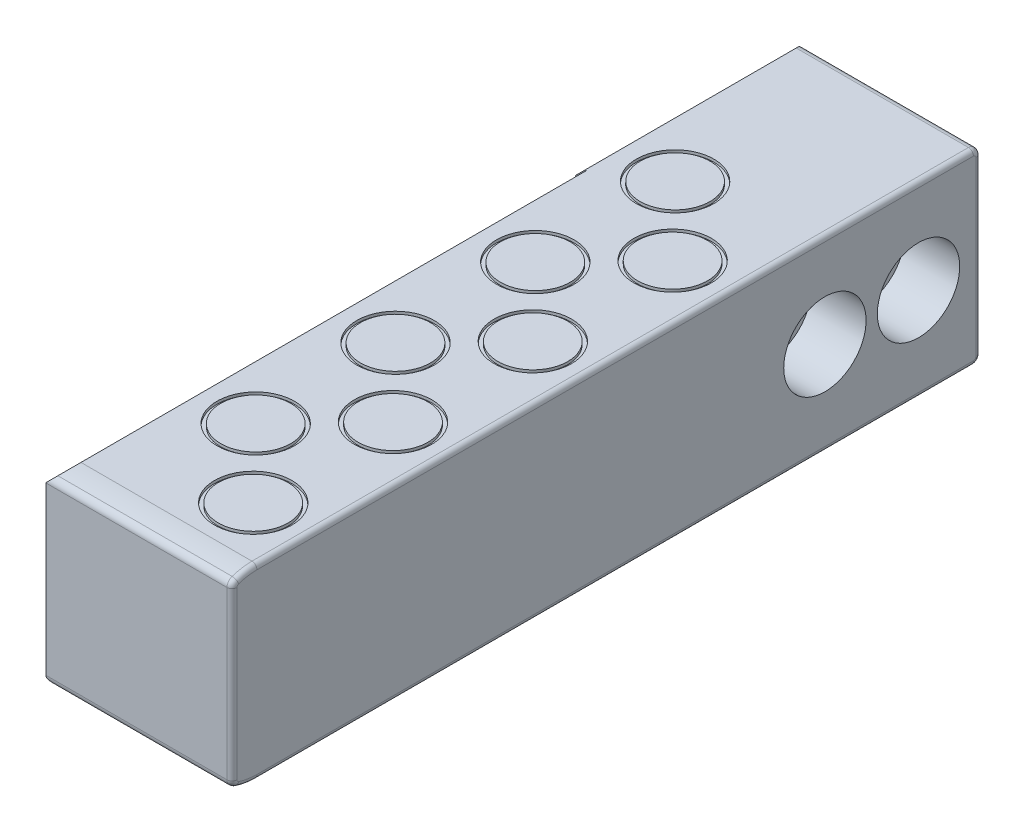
ISO-10303-21;
HEADER;
FILE_DESCRIPTION(('STEP AP214'),'2;1');
FILE_NAME('part.step','',(''),(''),'','','');
FILE_SCHEMA(('AUTOMOTIVE_DESIGN { 1 0 10303 214 1 1 1 1 }'));
ENDSEC;
DATA;
#1=APPLICATION_CONTEXT('core data for automotive mechanical design processes');
#2=APPLICATION_PROTOCOL_DEFINITION('international standard','automotive_design',2000,#1);
#3=PRODUCT_CONTEXT('',#1,'mechanical');
#4=PRODUCT('Part','Part','',(#3));
#5=PRODUCT_RELATED_PRODUCT_CATEGORY('part','',(#4));
#6=PRODUCT_DEFINITION_FORMATION('','',#4);
#7=PRODUCT_DEFINITION_CONTEXT('part definition',#1,'design');
#8=PRODUCT_DEFINITION('design','',#6,#7);
#9=PRODUCT_DEFINITION_SHAPE('','',#8);
#10=(LENGTH_UNIT() NAMED_UNIT(*) SI_UNIT(.MILLI.,.METRE.));
#11=(NAMED_UNIT(*) PLANE_ANGLE_UNIT() SI_UNIT($,.RADIAN.));
#12=(NAMED_UNIT(*) SI_UNIT($,.STERADIAN.) SOLID_ANGLE_UNIT());
#13=UNCERTAINTY_MEASURE_WITH_UNIT(LENGTH_MEASURE(1.E-05),#10,'distance_accuracy_value','');
#14=(GEOMETRIC_REPRESENTATION_CONTEXT(3) GLOBAL_UNCERTAINTY_ASSIGNED_CONTEXT((#13)) GLOBAL_UNIT_ASSIGNED_CONTEXT((#10,
#11,#12)) REPRESENTATION_CONTEXT('',''));
#15=CARTESIAN_POINT('',(0.,0.,0.));
#16=DIRECTION('',(0.,0.,1.));
#17=DIRECTION('',(1.,0.,0.));
#18=AXIS2_PLACEMENT_3D('',#15,#16,#17);
#19=CARTESIAN_POINT('',(0.,-8.47259001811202,53.213));
#20=DIRECTION('',(1.,0.,0.));
#21=DIRECTION('',(0.,0.,-1.));
#22=AXIS2_PLACEMENT_3D('',#19,#20,#21);
#23=PLANE('',#22);
#24=CARTESIAN_POINT('',(0.,0.,-15.875));
#25=DIRECTION('',(-1.,0.,0.));
#26=DIRECTION('',(0.,0.,1.));
#27=AXIS2_PLACEMENT_3D('',#24,#25,#26);
#28=CIRCLE('',#27,4.191);
#29=CARTESIAN_POINT('',(0.,0.,-11.684));
#30=VERTEX_POINT('',#29);
#31=EDGE_CURVE('E315',#30,#30,#28,.T.);
#32=ORIENTED_EDGE('',*,*,#31,.T.);
#33=EDGE_LOOP('',(#32));
#34=FACE_BOUND('',#33,.T.);
#35=CARTESIAN_POINT('',(0.,8.47259001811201,53.213));
#36=DIRECTION('',(1.,0.,0.));
#37=DIRECTION('',(0.,0.,-1.));
#38=AXIS2_PLACEMENT_3D('',#35,#36,#37);
#39=CIRCLE('',#38,0.253999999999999);
#40=CARTESIAN_POINT('',(0.,8.71338956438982,53.2938181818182));
#41=VERTEX_POINT('',#40);
#42=CARTESIAN_POINT('',(0.,8.47259001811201,53.467));
#43=VERTEX_POINT('',#42);
#44=EDGE_CURVE('E245',#41,#43,#39,.T.);
#45=ORIENTED_EDGE('',*,*,#44,.T.);
#46=DIRECTION('',(0.,-1.,0.));
#47=VECTOR('',#46,1.);
#48=CARTESIAN_POINT('',(0.,-8.47259001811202,53.467));
#49=LINE('',#48,#47);
#50=CARTESIAN_POINT('',(0.,-8.47259001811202,53.467));
#51=VERTEX_POINT('',#50);
#52=EDGE_CURVE('E247',#43,#51,#49,.T.);
#53=ORIENTED_EDGE('',*,*,#52,.T.);
#54=CARTESIAN_POINT('',(0.,-8.47259001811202,53.213));
#55=DIRECTION('',(1.,0.,0.));
#56=DIRECTION('',(0.,0.,-1.));
#57=AXIS2_PLACEMENT_3D('',#54,#55,#56);
#58=CIRCLE('',#57,0.253999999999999);
#59=CARTESIAN_POINT('',(0.,-8.71338956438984,53.2938181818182));
#60=VERTEX_POINT('',#59);
#61=EDGE_CURVE('E207',#51,#60,#58,.T.);
#62=ORIENTED_EDGE('',*,*,#61,.T.);
#63=CARTESIAN_POINT('',(0.,-3.17500000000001,51.435));
#64=DIRECTION('',(1.,0.,0.));
#65=DIRECTION('',(0.,0.,-1.));
#66=AXIS2_PLACEMENT_3D('',#63,#64,#65);
#67=CIRCLE('',#66,5.842);
#68=CARTESIAN_POINT('',(0.,-9.01700000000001,51.435));
#69=VERTEX_POINT('',#68);
#70=EDGE_CURVE('E209',#60,#69,#67,.T.);
#71=ORIENTED_EDGE('',*,*,#70,.T.);
#72=DIRECTION('',(0.,0.,-1.));
#73=VECTOR('',#72,1.);
#74=CARTESIAN_POINT('',(0.,-9.01700000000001,53.213));
#75=LINE('',#74,#73);
#76=CARTESIAN_POINT('',(0.,-9.017,-21.463));
#77=VERTEX_POINT('',#76);
#78=EDGE_CURVE('E233',#69,#77,#75,.T.);
#79=ORIENTED_EDGE('',*,*,#78,.T.);
#80=CARTESIAN_POINT('',(0.,-8.76300000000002,-21.463));
#81=DIRECTION('',(1.,0.,0.));
#82=DIRECTION('',(0.,0.,-1.));
#83=AXIS2_PLACEMENT_3D('',#80,#81,#82);
#84=CIRCLE('',#83,0.253999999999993);
#85=CARTESIAN_POINT('',(0.,-8.76300000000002,-21.717));
#86=VERTEX_POINT('',#85);
#87=EDGE_CURVE('E235',#77,#86,#84,.T.);
#88=ORIENTED_EDGE('',*,*,#87,.T.);
#89=DIRECTION('',(0.,1.,0.));
#90=VECTOR('',#89,1.);
#91=CARTESIAN_POINT('',(0.,-8.472590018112,-21.717));
#92=LINE('',#91,#90);
#93=CARTESIAN_POINT('',(0.,8.76300000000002,-21.717));
#94=VERTEX_POINT('',#93);
#95=EDGE_CURVE('E237',#86,#94,#92,.T.);
#96=ORIENTED_EDGE('',*,*,#95,.T.);
#97=CARTESIAN_POINT('',(0.,8.76300000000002,-21.463));
#98=DIRECTION('',(1.,0.,0.));
#99=DIRECTION('',(0.,0.,-1.));
#100=AXIS2_PLACEMENT_3D('',#97,#98,#99);
#101=CIRCLE('',#100,0.253999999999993);
#102=CARTESIAN_POINT('',(0.,9.01700000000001,-21.463));
#103=VERTEX_POINT('',#102);
#104=EDGE_CURVE('E239',#94,#103,#101,.T.);
#105=ORIENTED_EDGE('',*,*,#104,.T.);
#106=DIRECTION('',(0.,0.,1.));
#107=VECTOR('',#106,1.);
#108=CARTESIAN_POINT('',(0.,9.017,53.213));
#109=LINE('',#108,#107);
#110=CARTESIAN_POINT('',(0.,9.017,51.435));
#111=VERTEX_POINT('',#110);
#112=EDGE_CURVE('E241',#103,#111,#109,.T.);
#113=ORIENTED_EDGE('',*,*,#112,.T.);
#114=CARTESIAN_POINT('',(0.,3.175,51.435));
#115=DIRECTION('',(1.,0.,0.));
#116=DIRECTION('',(0.,0.,-1.));
#117=AXIS2_PLACEMENT_3D('',#114,#115,#116);
#118=CIRCLE('',#117,5.842);
#119=EDGE_CURVE('E243',#111,#41,#118,.T.);
#120=ORIENTED_EDGE('',*,*,#119,.T.);
#121=EDGE_LOOP('',(#45,#53,#62,#71,#79,#88,#96,#105,#113,#120));
#122=FACE_BOUND('',#121,.T.);
#123=CARTESIAN_POINT('',(0.,0.,-6.35));
#124=DIRECTION('',(-1.,0.,0.));
#125=DIRECTION('',(0.,0.,1.));
#126=AXIS2_PLACEMENT_3D('',#123,#124,#125);
#127=CIRCLE('',#126,4.191);
#128=CARTESIAN_POINT('',(0.,0.,-2.159));
#129=VERTEX_POINT('',#128);
#130=EDGE_CURVE('E372',#129,#129,#127,.T.);
#131=ORIENTED_EDGE('',*,*,#130,.T.);
#132=EDGE_LOOP('',(#131));
#133=FACE_BOUND('',#132,.T.);
#134=ADVANCED_FACE('F39',(#34,#122,#133),#23,.T.);
#135=CARTESIAN_POINT('',(-19.05,0.,-6.35));
#136=DIRECTION('',(1.,0.,0.));
#137=DIRECTION('',(0.,0.,-1.));
#138=AXIS2_PLACEMENT_3D('',#135,#136,#137);
#139=CYLINDRICAL_SURFACE('',#138,2.794);
#140=CARTESIAN_POINT('',(-19.05,0.,-6.35));
#141=DIRECTION('',(1.,0.,0.));
#142=DIRECTION('',(0.,0.,-1.));
#143=AXIS2_PLACEMENT_3D('',#140,#141,#142);
#144=CIRCLE('',#143,2.794);
#145=CARTESIAN_POINT('',(-19.05,0.,-9.144));
#146=VERTEX_POINT('',#145);
#147=EDGE_CURVE('E570',#146,#146,#144,.T.);
#148=CARTESIAN_POINT('',(-5.588,0.,-6.35));
#149=DIRECTION('',(1.,0.,0.));
#150=DIRECTION('',(0.,0.,-1.));
#151=AXIS2_PLACEMENT_3D('',#148,#149,#150);
#152=CIRCLE('',#151,2.794);
#153=CARTESIAN_POINT('',(-5.588,0.,-9.144));
#154=VERTEX_POINT('',#153);
#155=EDGE_CURVE('E312',#154,#154,#152,.F.);
#156=CARTESIAN_POINT('',(-19.05,0.,-9.144));
#157=CARTESIAN_POINT('',(-18.9097708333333,0.,-9.144));
#158=CARTESIAN_POINT('',(-18.7695416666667,0.,-9.144));
#159=CARTESIAN_POINT('',(-18.4890833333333,0.,-9.144));
#160=CARTESIAN_POINT('',(-18.3488541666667,0.,-9.144));
#161=CARTESIAN_POINT('',(-18.0683958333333,0.,-9.144));
#162=CARTESIAN_POINT('',(-17.9281666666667,0.,-9.144));
#163=CARTESIAN_POINT('',(-17.6477083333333,0.,-9.144));
#164=CARTESIAN_POINT('',(-17.5074791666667,0.,-9.144));
#165=CARTESIAN_POINT('',(-17.2270208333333,0.,-9.144));
#166=CARTESIAN_POINT('',(-17.0867916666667,0.,-9.144));
#167=CARTESIAN_POINT('',(-16.8063333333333,0.,-9.144));
#168=CARTESIAN_POINT('',(-16.6661041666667,0.,-9.144));
#169=CARTESIAN_POINT('',(-16.3856458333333,0.,-9.144));
#170=CARTESIAN_POINT('',(-16.2454166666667,0.,-9.144));
#171=CARTESIAN_POINT('',(-15.9649583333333,0.,-9.144));
#172=CARTESIAN_POINT('',(-15.8247291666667,0.,-9.144));
#173=CARTESIAN_POINT('',(-15.5442708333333,0.,-9.144));
#174=CARTESIAN_POINT('',(-15.4040416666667,0.,-9.144));
#175=CARTESIAN_POINT('',(-15.1235833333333,0.,-9.144));
#176=CARTESIAN_POINT('',(-14.9833541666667,0.,-9.144));
#177=CARTESIAN_POINT('',(-14.7028958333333,0.,-9.144));
#178=CARTESIAN_POINT('',(-14.5626666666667,0.,-9.144));
#179=CARTESIAN_POINT('',(-14.2822083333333,0.,-9.144));
#180=CARTESIAN_POINT('',(-14.1419791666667,0.,-9.144));
#181=CARTESIAN_POINT('',(-13.8615208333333,0.,-9.144));
#182=CARTESIAN_POINT('',(-13.7212916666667,0.,-9.144));
#183=CARTESIAN_POINT('',(-13.4408333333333,0.,-9.144));
#184=CARTESIAN_POINT('',(-13.3006041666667,0.,-9.144));
#185=CARTESIAN_POINT('',(-13.0201458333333,0.,-9.144));
#186=CARTESIAN_POINT('',(-12.8799166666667,0.,-9.144));
#187=CARTESIAN_POINT('',(-12.5994583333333,0.,-9.144));
#188=CARTESIAN_POINT('',(-12.4592291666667,0.,-9.144));
#189=CARTESIAN_POINT('',(-12.1787708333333,0.,-9.144));
#190=CARTESIAN_POINT('',(-12.0385416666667,0.,-9.144));
#191=CARTESIAN_POINT('',(-11.7580833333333,0.,-9.144));
#192=CARTESIAN_POINT('',(-11.6178541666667,0.,-9.144));
#193=CARTESIAN_POINT('',(-11.3373958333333,0.,-9.144));
#194=CARTESIAN_POINT('',(-11.1971666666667,0.,-9.144));
#195=CARTESIAN_POINT('',(-10.9167083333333,0.,-9.144));
#196=CARTESIAN_POINT('',(-10.7764791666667,0.,-9.144));
#197=CARTESIAN_POINT('',(-10.4960208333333,0.,-9.144));
#198=CARTESIAN_POINT('',(-10.3557916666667,0.,-9.144));
#199=CARTESIAN_POINT('',(-10.0753333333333,0.,-9.144));
#200=CARTESIAN_POINT('',(-9.93510416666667,0.,-9.144));
#201=CARTESIAN_POINT('',(-9.65464583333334,0.,-9.144));
#202=CARTESIAN_POINT('',(-9.51441666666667,0.,-9.144));
#203=CARTESIAN_POINT('',(-9.23395833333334,0.,-9.144));
#204=CARTESIAN_POINT('',(-9.09372916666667,0.,-9.144));
#205=CARTESIAN_POINT('',(-8.81327083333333,0.,-9.144));
#206=CARTESIAN_POINT('',(-8.67304166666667,0.,-9.144));
#207=CARTESIAN_POINT('',(-8.39258333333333,0.,-9.144));
#208=CARTESIAN_POINT('',(-8.25235416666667,0.,-9.144));
#209=CARTESIAN_POINT('',(-7.97189583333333,0.,-9.144));
#210=CARTESIAN_POINT('',(-7.83166666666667,0.,-9.144));
#211=CARTESIAN_POINT('',(-7.55120833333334,0.,-9.144));
#212=CARTESIAN_POINT('',(-7.41097916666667,0.,-9.144));
#213=CARTESIAN_POINT('',(-7.13052083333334,0.,-9.144));
#214=CARTESIAN_POINT('',(-6.99029166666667,0.,-9.144));
#215=CARTESIAN_POINT('',(-6.70983333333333,0.,-9.144));
#216=CARTESIAN_POINT('',(-6.56960416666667,0.,-9.144));
#217=CARTESIAN_POINT('',(-6.28914583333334,0.,-9.144));
#218=CARTESIAN_POINT('',(-6.14891666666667,0.,-9.144));
#219=CARTESIAN_POINT('',(-5.86845833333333,0.,-9.144));
#220=CARTESIAN_POINT('',(-5.72822916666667,0.,-9.144));
#221=CARTESIAN_POINT('',(-5.588,0.,-9.144));
#222=B_SPLINE_CURVE_WITH_KNOTS('',3,(#156,#157,#158,#159,#160,#161,#162,#163,#164,#165,#166,
#167,#168,#169,#170,#171,#172,#173,#174,#175,#176,#177,#178,#179,#180,#181,#182,#183,#184,#185,
#186,#187,#188,#189,#190,#191,#192,#193,#194,#195,#196,#197,#198,#199,#200,#201,#202,#203,#204,
#205,#206,#207,#208,#209,#210,#211,#212,#213,#214,#215,#216,#217,#218,#219,#220,#221),
.UNSPECIFIED.,.F.,.F.,(4,2,2,2,2,2,2,2,2,2,2,2,2,2,2,2,2,2,2,2,2,2,2,2,2,2,2,2,2,2,2,2,4),(0.,
0.420687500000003,0.841375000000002,1.2620625,1.68275,2.1034375,2.524125,2.9448125,3.3655,
3.7861875,4.206875,4.6275625,5.04825,5.4689375,5.889625,6.3103125,6.731,7.1516875,7.572375,
7.9930625,8.41375,8.8344375,9.255125,9.6758125,10.0965,10.5171875,10.937875,11.3585625,11.77925,
12.1999375,12.620625,13.0413125,13.462),.UNSPECIFIED.);
#223=EDGE_CURVE('BSEAM585',#146,#154,#222,.T.);
#224=ORIENTED_EDGE('',*,*,#147,.F.);
#225=ORIENTED_EDGE('',*,*,#155,.F.);
#226=ORIENTED_EDGE('',*,*,#223,.T.);
#227=ORIENTED_EDGE('',*,*,#223,.F.);
#228=EDGE_LOOP('',(#224,#226,#225,#227));
#229=FACE_BOUND('',#228,.T.);
#230=ADVANCED_FACE('F585',(#229),#139,.F.);
#231=CARTESIAN_POINT('',(-19.05,0.,-15.875));
#232=DIRECTION('',(1.,0.,0.));
#233=DIRECTION('',(0.,0.,-1.));
#234=AXIS2_PLACEMENT_3D('',#231,#232,#233);
#235=CYLINDRICAL_SURFACE('',#234,2.794);
#236=CARTESIAN_POINT('',(-19.05,0.,-15.875));
#237=DIRECTION('',(1.,0.,0.));
#238=DIRECTION('',(0.,0.,-1.));
#239=AXIS2_PLACEMENT_3D('',#236,#237,#238);
#240=CIRCLE('',#239,2.794);
#241=CARTESIAN_POINT('',(-19.05,0.,-18.669));
#242=VERTEX_POINT('',#241);
#243=EDGE_CURVE('E214',#242,#242,#240,.T.);
#244=CARTESIAN_POINT('',(-5.588,0.,-15.875));
#245=DIRECTION('',(1.,0.,0.));
#246=DIRECTION('',(0.,0.,-1.));
#247=AXIS2_PLACEMENT_3D('',#244,#245,#246);
#248=CIRCLE('',#247,2.794);
#249=CARTESIAN_POINT('',(-5.588,0.,-18.669));
#250=VERTEX_POINT('',#249);
#251=EDGE_CURVE('E281',#250,#250,#248,.F.);
#252=CARTESIAN_POINT('',(-19.05,0.,-18.669));
#253=CARTESIAN_POINT('',(-18.9097708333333,0.,-18.669));
#254=CARTESIAN_POINT('',(-18.7695416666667,0.,-18.669));
#255=CARTESIAN_POINT('',(-18.4890833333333,0.,-18.669));
#256=CARTESIAN_POINT('',(-18.3488541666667,0.,-18.669));
#257=CARTESIAN_POINT('',(-18.0683958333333,0.,-18.669));
#258=CARTESIAN_POINT('',(-17.9281666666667,0.,-18.669));
#259=CARTESIAN_POINT('',(-17.6477083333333,0.,-18.669));
#260=CARTESIAN_POINT('',(-17.5074791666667,0.,-18.669));
#261=CARTESIAN_POINT('',(-17.2270208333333,0.,-18.669));
#262=CARTESIAN_POINT('',(-17.0867916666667,0.,-18.669));
#263=CARTESIAN_POINT('',(-16.8063333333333,0.,-18.669));
#264=CARTESIAN_POINT('',(-16.6661041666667,0.,-18.669));
#265=CARTESIAN_POINT('',(-16.3856458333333,0.,-18.669));
#266=CARTESIAN_POINT('',(-16.2454166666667,0.,-18.669));
#267=CARTESIAN_POINT('',(-15.9649583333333,0.,-18.669));
#268=CARTESIAN_POINT('',(-15.8247291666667,0.,-18.669));
#269=CARTESIAN_POINT('',(-15.5442708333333,0.,-18.669));
#270=CARTESIAN_POINT('',(-15.4040416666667,0.,-18.669));
#271=CARTESIAN_POINT('',(-15.1235833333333,0.,-18.669));
#272=CARTESIAN_POINT('',(-14.9833541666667,0.,-18.669));
#273=CARTESIAN_POINT('',(-14.7028958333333,0.,-18.669));
#274=CARTESIAN_POINT('',(-14.5626666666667,0.,-18.669));
#275=CARTESIAN_POINT('',(-14.2822083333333,0.,-18.669));
#276=CARTESIAN_POINT('',(-14.1419791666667,0.,-18.669));
#277=CARTESIAN_POINT('',(-13.8615208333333,0.,-18.669));
#278=CARTESIAN_POINT('',(-13.7212916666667,0.,-18.669));
#279=CARTESIAN_POINT('',(-13.4408333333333,0.,-18.669));
#280=CARTESIAN_POINT('',(-13.3006041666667,0.,-18.669));
#281=CARTESIAN_POINT('',(-13.0201458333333,0.,-18.669));
#282=CARTESIAN_POINT('',(-12.8799166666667,0.,-18.669));
#283=CARTESIAN_POINT('',(-12.5994583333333,0.,-18.669));
#284=CARTESIAN_POINT('',(-12.4592291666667,0.,-18.669));
#285=CARTESIAN_POINT('',(-12.1787708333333,0.,-18.669));
#286=CARTESIAN_POINT('',(-12.0385416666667,0.,-18.669));
#287=CARTESIAN_POINT('',(-11.7580833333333,0.,-18.669));
#288=CARTESIAN_POINT('',(-11.6178541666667,0.,-18.669));
#289=CARTESIAN_POINT('',(-11.3373958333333,0.,-18.669));
#290=CARTESIAN_POINT('',(-11.1971666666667,0.,-18.669));
#291=CARTESIAN_POINT('',(-10.9167083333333,0.,-18.669));
#292=CARTESIAN_POINT('',(-10.7764791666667,0.,-18.669));
#293=CARTESIAN_POINT('',(-10.4960208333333,0.,-18.669));
#294=CARTESIAN_POINT('',(-10.3557916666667,0.,-18.669));
#295=CARTESIAN_POINT('',(-10.0753333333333,0.,-18.669));
#296=CARTESIAN_POINT('',(-9.93510416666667,0.,-18.669));
#297=CARTESIAN_POINT('',(-9.65464583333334,0.,-18.669));
#298=CARTESIAN_POINT('',(-9.51441666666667,0.,-18.669));
#299=CARTESIAN_POINT('',(-9.23395833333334,0.,-18.669));
#300=CARTESIAN_POINT('',(-9.09372916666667,0.,-18.669));
#301=CARTESIAN_POINT('',(-8.81327083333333,0.,-18.669));
#302=CARTESIAN_POINT('',(-8.67304166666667,0.,-18.669));
#303=CARTESIAN_POINT('',(-8.39258333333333,0.,-18.669));
#304=CARTESIAN_POINT('',(-8.25235416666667,0.,-18.669));
#305=CARTESIAN_POINT('',(-7.97189583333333,0.,-18.669));
#306=CARTESIAN_POINT('',(-7.83166666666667,0.,-18.669));
#307=CARTESIAN_POINT('',(-7.55120833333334,0.,-18.669));
#308=CARTESIAN_POINT('',(-7.41097916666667,0.,-18.669));
#309=CARTESIAN_POINT('',(-7.13052083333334,0.,-18.669));
#310=CARTESIAN_POINT('',(-6.99029166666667,0.,-18.669));
#311=CARTESIAN_POINT('',(-6.70983333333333,0.,-18.669));
#312=CARTESIAN_POINT('',(-6.56960416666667,0.,-18.669));
#313=CARTESIAN_POINT('',(-6.28914583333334,0.,-18.669));
#314=CARTESIAN_POINT('',(-6.14891666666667,0.,-18.669));
#315=CARTESIAN_POINT('',(-5.86845833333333,0.,-18.669));
#316=CARTESIAN_POINT('',(-5.72822916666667,0.,-18.669));
#317=CARTESIAN_POINT('',(-5.588,0.,-18.669));
#318=B_SPLINE_CURVE_WITH_KNOTS('',3,(#252,#253,#254,#255,#256,#257,#258,#259,#260,#261,#262,
#263,#264,#265,#266,#267,#268,#269,#270,#271,#272,#273,#274,#275,#276,#277,#278,#279,#280,#281,
#282,#283,#284,#285,#286,#287,#288,#289,#290,#291,#292,#293,#294,#295,#296,#297,#298,#299,#300,
#301,#302,#303,#304,#305,#306,#307,#308,#309,#310,#311,#312,#313,#314,#315,#316,#317),
.UNSPECIFIED.,.F.,.F.,(4,2,2,2,2,2,2,2,2,2,2,2,2,2,2,2,2,2,2,2,2,2,2,2,2,2,2,2,2,2,2,2,4),(0.,
0.420687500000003,0.841375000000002,1.2620625,1.68275,2.1034375,2.524125,2.9448125,3.3655,
3.7861875,4.206875,4.6275625,5.04825,5.4689375,5.889625,6.3103125,6.731,7.1516875,7.572375,
7.9930625,8.41375,8.8344375,9.255125,9.6758125,10.0965,10.5171875,10.937875,11.3585625,11.77925,
12.1999375,12.620625,13.0413125,13.462),.UNSPECIFIED.);
#319=EDGE_CURVE('BSEAM581',#242,#250,#318,.T.);
#320=ORIENTED_EDGE('',*,*,#243,.F.);
#321=ORIENTED_EDGE('',*,*,#251,.F.);
#322=ORIENTED_EDGE('',*,*,#319,.T.);
#323=ORIENTED_EDGE('',*,*,#319,.F.);
#324=EDGE_LOOP('',(#320,#322,#321,#323));
#325=FACE_BOUND('',#324,.T.);
#326=ADVANCED_FACE('F581',(#325),#235,.F.);
#327=CARTESIAN_POINT('',(-19.05,-9.52500000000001,51.435));
#328=DIRECTION('',(0.,-1.,0.));
#329=DIRECTION('',(0.,0.,-1.));
#330=AXIS2_PLACEMENT_3D('',#327,#328,#329);
#331=PLANE('',#330);
#332=DIRECTION('',(1.,0.,0.));
#333=VECTOR('',#332,1.);
#334=CARTESIAN_POINT('',(-19.05,-9.52500000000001,51.435));
#335=LINE('',#334,#333);
#336=CARTESIAN_POINT('',(-18.034,-9.52500000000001,51.435));
#337=VERTEX_POINT('',#336);
#338=CARTESIAN_POINT('',(-0.508000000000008,-9.52500000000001,51.435));
#339=VERTEX_POINT('',#338);
#340=EDGE_CURVE('E228',#337,#339,#335,.T.);
#341=ORIENTED_EDGE('',*,*,#340,.F.);
#342=DIRECTION('',(0.,0.,-1.));
#343=VECTOR('',#342,1.);
#344=CARTESIAN_POINT('',(-18.034,-9.525,-21.463));
#345=LINE('',#344,#343);
#346=CARTESIAN_POINT('',(-18.034,-9.52500000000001,-21.463));
#347=VERTEX_POINT('',#346);
#348=EDGE_CURVE('E331',#337,#347,#345,.T.);
#349=ORIENTED_EDGE('',*,*,#348,.T.);
#350=DIRECTION('',(1.,0.,0.));
#351=VECTOR('',#350,1.);
#352=CARTESIAN_POINT('',(-19.05,-9.52500000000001,-21.463));
#353=LINE('',#352,#351);
#354=CARTESIAN_POINT('',(-0.508000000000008,-9.52500000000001,-21.463));
#355=VERTEX_POINT('',#354);
#356=EDGE_CURVE('E226',#347,#355,#353,.T.);
#357=ORIENTED_EDGE('',*,*,#356,.T.);
#358=DIRECTION('',(0.,0.,-1.));
#359=VECTOR('',#358,1.);
#360=CARTESIAN_POINT('',(-0.508000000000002,-9.52500000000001,51.435));
#361=LINE('',#360,#359);
#362=EDGE_CURVE('E270',#355,#339,#361,.F.);
#363=ORIENTED_EDGE('',*,*,#362,.T.);
#364=EDGE_LOOP('',(#341,#349,#357,#363));
#365=FACE_BOUND('',#364,.T.);
#366=CARTESIAN_POINT('',(-12.446,-9.525,39.116));
#367=DIRECTION('',(0.,1.,0.));
#368=DIRECTION('',(0.,0.,1.));
#369=AXIS2_PLACEMENT_3D('',#366,#367,#368);
#370=CIRCLE('',#369,3.93700000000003);
#371=CARTESIAN_POINT('',(-12.446,-9.525,43.053));
#372=VERTEX_POINT('',#371);
#373=EDGE_CURVE('E468',#372,#372,#370,.T.);
#374=ORIENTED_EDGE('',*,*,#373,.T.);
#375=EDGE_LOOP('',(#374));
#376=FACE_BOUND('',#375,.T.);
#377=CARTESIAN_POINT('',(-5.588,-9.525,46.228));
#378=DIRECTION('',(0.,1.,0.));
#379=DIRECTION('',(0.,0.,-1.));
#380=AXIS2_PLACEMENT_3D('',#377,#378,#379);
#381=CIRCLE('',#380,3.93700000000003);
#382=CARTESIAN_POINT('',(-5.588,-9.525,42.291));
#383=VERTEX_POINT('',#382);
#384=EDGE_CURVE('E456',#383,#383,#381,.T.);
#385=ORIENTED_EDGE('',*,*,#384,.T.);
#386=EDGE_LOOP('',(#385));
#387=FACE_BOUND('',#386,.T.);
#388=CARTESIAN_POINT('',(-12.446,-9.525,24.892));
#389=DIRECTION('',(0.,1.,0.));
#390=DIRECTION('',(0.,0.,1.));
#391=AXIS2_PLACEMENT_3D('',#388,#389,#390);
#392=CIRCLE('',#391,3.93700000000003);
#393=CARTESIAN_POINT('',(-12.446,-9.525,28.829));
#394=VERTEX_POINT('',#393);
#395=EDGE_CURVE('E444',#394,#394,#392,.T.);
#396=ORIENTED_EDGE('',*,*,#395,.T.);
#397=EDGE_LOOP('',(#396));
#398=FACE_BOUND('',#397,.T.);
#399=CARTESIAN_POINT('',(-5.588,-9.525,32.004));
#400=DIRECTION('',(0.,1.,0.));
#401=DIRECTION('',(0.,0.,-1.));
#402=AXIS2_PLACEMENT_3D('',#399,#400,#401);
#403=CIRCLE('',#402,3.93700000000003);
#404=CARTESIAN_POINT('',(-5.588,-9.525,28.067));
#405=VERTEX_POINT('',#404);
#406=EDGE_CURVE('E432',#405,#405,#403,.T.);
#407=ORIENTED_EDGE('',*,*,#406,.T.);
#408=EDGE_LOOP('',(#407));
#409=FACE_BOUND('',#408,.T.);
#410=CARTESIAN_POINT('',(-12.446,-9.525,10.668));
#411=DIRECTION('',(0.,1.,0.));
#412=DIRECTION('',(0.,0.,1.));
#413=AXIS2_PLACEMENT_3D('',#410,#411,#412);
#414=CIRCLE('',#413,3.93700000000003);
#415=CARTESIAN_POINT('',(-12.446,-9.525,14.605));
#416=VERTEX_POINT('',#415);
#417=EDGE_CURVE('E420',#416,#416,#414,.T.);
#418=ORIENTED_EDGE('',*,*,#417,.T.);
#419=EDGE_LOOP('',(#418));
#420=FACE_BOUND('',#419,.T.);
#421=CARTESIAN_POINT('',(-5.588,-9.525,17.78));
#422=DIRECTION('',(0.,1.,0.));
#423=DIRECTION('',(0.,0.,-1.));
#424=AXIS2_PLACEMENT_3D('',#421,#422,#423);
#425=CIRCLE('',#424,3.93700000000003);
#426=CARTESIAN_POINT('',(-5.588,-9.525,13.843));
#427=VERTEX_POINT('',#426);
#428=EDGE_CURVE('E408',#427,#427,#425,.T.);
#429=ORIENTED_EDGE('',*,*,#428,.T.);
#430=EDGE_LOOP('',(#429));
#431=FACE_BOUND('',#430,.T.);
#432=CARTESIAN_POINT('',(-12.446,-9.525,-3.55599999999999));
#433=DIRECTION('',(0.,1.,0.));
#434=DIRECTION('',(0.,0.,1.));
#435=AXIS2_PLACEMENT_3D('',#432,#433,#434);
#436=CIRCLE('',#435,3.93700000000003);
#437=CARTESIAN_POINT('',(-12.446,-9.525,0.381000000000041));
#438=VERTEX_POINT('',#437);
#439=EDGE_CURVE('E396',#438,#438,#436,.T.);
#440=ORIENTED_EDGE('',*,*,#439,.T.);
#441=EDGE_LOOP('',(#440));
#442=FACE_BOUND('',#441,.T.);
#443=CARTESIAN_POINT('',(-5.588,-9.525,3.55600000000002));
#444=DIRECTION('',(0.,1.,0.));
#445=DIRECTION('',(0.,0.,-1.));
#446=AXIS2_PLACEMENT_3D('',#443,#444,#445);
#447=CIRCLE('',#446,3.93700000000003);
#448=CARTESIAN_POINT('',(-5.588,-9.525,-0.381000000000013));
#449=VERTEX_POINT('',#448);
#450=EDGE_CURVE('E384',#449,#449,#447,.T.);
#451=ORIENTED_EDGE('',*,*,#450,.T.);
#452=EDGE_LOOP('',(#451));
#453=FACE_BOUND('',#452,.T.);
#454=ADVANCED_FACE('F584',(#365,#376,#387,#398,#409,#420,#431,#442,#453),#331,.T.);
#455=CARTESIAN_POINT('',(-19.05,-8.47259001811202,53.213));
#456=DIRECTION('',(1.,0.,0.));
#457=DIRECTION('',(0.,0.,-1.));
#458=AXIS2_PLACEMENT_3D('',#455,#456,#457);
#459=CYLINDRICAL_SURFACE('',#458,0.761999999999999);
#460=CARTESIAN_POINT('',(-18.923,-8.47259001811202,53.213));
#461=DIRECTION('',(1.,0.,0.));
#462=DIRECTION('',(0.,0.,-1.));
#463=AXIS2_PLACEMENT_3D('',#460,#461,#462);
#464=CIRCLE('',#463,0.761999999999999);
#465=CARTESIAN_POINT('',(-18.923,-8.63600000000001,53.9572722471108));
#466=VERTEX_POINT('',#465);
#467=CARTESIAN_POINT('',(-18.923,-8.47259001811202,53.975));
#468=VERTEX_POINT('',#467);
#469=EDGE_CURVE('E180',#466,#468,#464,.F.);
#470=ORIENTED_EDGE('',*,*,#469,.F.);
#471=CARTESIAN_POINT('',(-19.086409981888,-8.47259001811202,53.213));
#472=DIRECTION('',(-0.70710678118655,-0.707106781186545,0.));
#473=DIRECTION('',(0.707106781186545,-0.70710678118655,0.));
#474=AXIS2_PLACEMENT_3D('',#471,#472,#473);
#475=ELLIPSE('',#474,1.07763073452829,0.761999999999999);
#476=CARTESIAN_POINT('',(-18.3640113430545,-9.19498865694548,53.4554545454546));
#477=VERTEX_POINT('',#476);
#478=EDGE_CURVE('E349',#466,#477,#475,.F.);
#479=ORIENTED_EDGE('',*,*,#478,.T.);
#480=DIRECTION('',(1.,0.,0.));
#481=VECTOR('',#480,1.);
#482=CARTESIAN_POINT('',(-19.05,-9.19498865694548,53.4554545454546));
#483=LINE('',#482,#481);
#484=CARTESIAN_POINT('',(-0.507999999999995,-9.19498865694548,53.4554545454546));
#485=VERTEX_POINT('',#484);
#486=EDGE_CURVE('E230',#477,#485,#483,.T.);
#487=ORIENTED_EDGE('',*,*,#486,.T.);
#488=CARTESIAN_POINT('',(-0.507999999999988,-8.47259001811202,53.213));
#489=DIRECTION('',(1.,0.,0.));
#490=DIRECTION('',(0.,0.,-1.));
#491=AXIS2_PLACEMENT_3D('',#488,#489,#490);
#492=CIRCLE('',#491,0.761999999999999);
#493=CARTESIAN_POINT('',(-0.507999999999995,-8.47259001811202,53.975));
#494=VERTEX_POINT('',#493);
#495=EDGE_CURVE('E205',#485,#494,#492,.F.);
#496=ORIENTED_EDGE('',*,*,#495,.T.);
#497=DIRECTION('',(1.,0.,0.));
#498=VECTOR('',#497,1.);
#499=CARTESIAN_POINT('',(-19.05,-8.47259001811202,53.975));
#500=LINE('',#499,#498);
#501=EDGE_CURVE('E198',#468,#494,#500,.T.);
#502=ORIENTED_EDGE('',*,*,#501,.F.);
#503=EDGE_LOOP('',(#470,#479,#487,#496,#502));
#504=FACE_BOUND('',#503,.T.);
#505=ADVANCED_FACE('F203',(#504),#459,.T.);
#506=CARTESIAN_POINT('',(-19.05,-8.47259001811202,53.975));
#507=DIRECTION('',(0.,0.,1.));
#508=DIRECTION('',(1.,0.,0.));
#509=AXIS2_PLACEMENT_3D('',#506,#507,#508);
#510=PLANE('',#509);
#511=DIRECTION('',(0.,1.,0.));
#512=VECTOR('',#511,1.);
#513=CARTESIAN_POINT('',(-18.923,-8.47259001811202,53.975));
#514=LINE('',#513,#512);
#515=CARTESIAN_POINT('',(-18.923,8.47259001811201,53.975));
#516=VERTEX_POINT('',#515);
#517=EDGE_CURVE('E185',#468,#516,#514,.T.);
#518=ORIENTED_EDGE('',*,*,#517,.F.);
#519=ORIENTED_EDGE('',*,*,#501,.T.);
#520=DIRECTION('',(0.,-1.,0.));
#521=VECTOR('',#520,1.);
#522=CARTESIAN_POINT('',(-0.508000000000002,-8.47259001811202,53.975));
#523=LINE('',#522,#521);
#524=CARTESIAN_POINT('',(-0.507999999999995,8.47259001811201,53.975));
#525=VERTEX_POINT('',#524);
#526=EDGE_CURVE('E250',#494,#525,#523,.F.);
#527=ORIENTED_EDGE('',*,*,#526,.T.);
#528=DIRECTION('',(1.,0.,0.));
#529=VECTOR('',#528,1.);
#530=CARTESIAN_POINT('',(-19.05,8.47259001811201,53.975));
#531=LINE('',#530,#529);
#532=EDGE_CURVE('E200',#516,#525,#531,.T.);
#533=ORIENTED_EDGE('',*,*,#532,.F.);
#534=EDGE_LOOP('',(#518,#519,#527,#533));
#535=FACE_BOUND('',#534,.T.);
#536=ADVANCED_FACE('F196',(#535),#510,.T.);
#537=CARTESIAN_POINT('',(-19.05,8.47259001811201,53.213));
#538=DIRECTION('',(1.,0.,0.));
#539=DIRECTION('',(0.,0.,-1.));
#540=AXIS2_PLACEMENT_3D('',#537,#538,#539);
#541=CYLINDRICAL_SURFACE('',#540,0.761999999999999);
#542=DIRECTION('',(1.,0.,0.));
#543=VECTOR('',#542,1.);
#544=CARTESIAN_POINT('',(-19.05,9.19498865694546,53.4554545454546));
#545=LINE('',#544,#543);
#546=CARTESIAN_POINT('',(-18.2370113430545,9.19498865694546,53.4554545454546));
#547=VERTEX_POINT('',#546);
#548=CARTESIAN_POINT('',(-0.508000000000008,9.19498865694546,53.4554545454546));
#549=VERTEX_POINT('',#548);
#550=EDGE_CURVE('E211',#547,#549,#545,.T.);
#551=ORIENTED_EDGE('',*,*,#550,.F.);
#552=CARTESIAN_POINT('',(-18.959409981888,8.47259001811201,53.213));
#553=DIRECTION('',(-0.707106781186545,0.70710678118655,0.));
#554=DIRECTION('',(0.70710678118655,0.707106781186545,0.));
#555=AXIS2_PLACEMENT_3D('',#552,#553,#554);
#556=ELLIPSE('',#555,1.0776307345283,0.761999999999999);
#557=CARTESIAN_POINT('',(-18.923,8.50900000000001,53.9741296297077));
#558=VERTEX_POINT('',#557);
#559=EDGE_CURVE('E326',#547,#558,#556,.F.);
#560=ORIENTED_EDGE('',*,*,#559,.T.);
#561=CARTESIAN_POINT('',(-18.923,8.47259001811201,53.213));
#562=DIRECTION('',(1.,0.,0.));
#563=DIRECTION('',(0.,0.,-1.));
#564=AXIS2_PLACEMENT_3D('',#561,#562,#563);
#565=CIRCLE('',#564,0.761999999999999);
#566=EDGE_CURVE('E201',#516,#558,#565,.F.);
#567=ORIENTED_EDGE('',*,*,#566,.F.);
#568=ORIENTED_EDGE('',*,*,#532,.T.);
#569=CARTESIAN_POINT('',(-0.507999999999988,8.47259001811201,53.213));
#570=DIRECTION('',(1.,0.,0.));
#571=DIRECTION('',(0.,0.,-1.));
#572=AXIS2_PLACEMENT_3D('',#569,#570,#571);
#573=CIRCLE('',#572,0.761999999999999);
#574=EDGE_CURVE('E252',#525,#549,#573,.F.);
#575=ORIENTED_EDGE('',*,*,#574,.T.);
#576=EDGE_LOOP('',(#551,#560,#567,#568,#575));
#577=FACE_BOUND('',#576,.T.);
#578=ADVANCED_FACE('F620',(#577),#541,.T.);
#579=CARTESIAN_POINT('',(-19.05,3.175,51.435));
#580=DIRECTION('',(1.,0.,0.));
#581=DIRECTION('',(0.,0.,-1.));
#582=AXIS2_PLACEMENT_3D('',#579,#580,#581);
#583=CYLINDRICAL_SURFACE('',#582,6.35);
#584=DIRECTION('',(1.,0.,0.));
#585=VECTOR('',#584,1.);
#586=CARTESIAN_POINT('',(-19.05,9.525,51.435));
#587=LINE('',#586,#585);
#588=CARTESIAN_POINT('',(-17.907,9.525,51.435));
#589=VERTEX_POINT('',#588);
#590=CARTESIAN_POINT('',(-0.508000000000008,9.525,51.435));
#591=VERTEX_POINT('',#590);
#592=EDGE_CURVE('E218',#589,#591,#587,.T.);
#593=ORIENTED_EDGE('',*,*,#592,.F.);
#594=CARTESIAN_POINT('',(-24.257,3.175,51.435));
#595=DIRECTION('',(-0.707106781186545,0.70710678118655,0.));
#596=DIRECTION('',(0.70710678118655,0.707106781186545,0.));
#597=AXIS2_PLACEMENT_3D('',#594,#595,#596);
#598=ELLIPSE('',#597,8.98025612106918,6.35);
#599=EDGE_CURVE('E324',#589,#547,#598,.F.);
#600=ORIENTED_EDGE('',*,*,#599,.T.);
#601=ORIENTED_EDGE('',*,*,#550,.T.);
#602=CARTESIAN_POINT('',(-0.508000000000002,3.175,51.435));
#603=DIRECTION('',(1.,0.,0.));
#604=DIRECTION('',(0.,0.,-1.));
#605=AXIS2_PLACEMENT_3D('',#602,#603,#604);
#606=CIRCLE('',#605,6.35);
#607=EDGE_CURVE('E255',#549,#591,#606,.F.);
#608=ORIENTED_EDGE('',*,*,#607,.T.);
#609=EDGE_LOOP('',(#593,#600,#601,#608));
#610=FACE_BOUND('',#609,.T.);
#611=ADVANCED_FACE('F623',(#610),#583,.T.);
#612=CARTESIAN_POINT('',(-19.05,9.525,51.435));
#613=DIRECTION('',(0.,1.,0.));
#614=DIRECTION('',(0.,0.,1.));
#615=AXIS2_PLACEMENT_3D('',#612,#613,#614);
#616=PLANE('',#615);
#617=DIRECTION('',(1.,0.,0.));
#618=VECTOR('',#617,1.);
#619=CARTESIAN_POINT('',(-19.05,9.525,-21.463));
#620=LINE('',#619,#618);
#621=CARTESIAN_POINT('',(-18.034,9.525,-21.463));
#622=VERTEX_POINT('',#621);
#623=CARTESIAN_POINT('',(-0.507999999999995,9.525,-21.463));
#624=VERTEX_POINT('',#623);
#625=EDGE_CURVE('E220',#622,#624,#620,.T.);
#626=ORIENTED_EDGE('',*,*,#625,.F.);
#627=DIRECTION('',(0.,0.,1.));
#628=VECTOR('',#627,1.);
#629=CARTESIAN_POINT('',(-18.034,9.525,0.));
#630=LINE('',#629,#628);
#631=CARTESIAN_POINT('',(-18.034,9.525,0.));
#632=VERTEX_POINT('',#631);
#633=EDGE_CURVE('E11',#622,#632,#630,.T.);
#634=ORIENTED_EDGE('',*,*,#633,.T.);
#635=DIRECTION('',(-1.,0.,0.));
#636=VECTOR('',#635,1.);
#637=CARTESIAN_POINT('',(-19.05,9.525,0.));
#638=LINE('',#637,#636);
#639=CARTESIAN_POINT('',(-17.907,9.525,0.));
#640=VERTEX_POINT('',#639);
#641=EDGE_CURVE('E192',#640,#632,#638,.T.);
#642=ORIENTED_EDGE('',*,*,#641,.F.);
#643=DIRECTION('',(0.,0.,1.));
#644=VECTOR('',#643,1.);
#645=CARTESIAN_POINT('',(-17.907,9.525,51.435));
#646=LINE('',#645,#644);
#647=EDGE_CURVE('E322',#640,#589,#646,.T.);
#648=ORIENTED_EDGE('',*,*,#647,.T.);
#649=ORIENTED_EDGE('',*,*,#592,.T.);
#650=DIRECTION('',(0.,0.,1.));
#651=VECTOR('',#650,1.);
#652=CARTESIAN_POINT('',(-0.508000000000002,9.525,51.435));
#653=LINE('',#652,#651);
#654=EDGE_CURVE('E258',#591,#624,#653,.F.);
#655=ORIENTED_EDGE('',*,*,#654,.T.);
#656=EDGE_LOOP('',(#626,#634,#642,#648,#649,#655));
#657=FACE_BOUND('',#656,.T.);
#658=CARTESIAN_POINT('',(-5.588,9.525,3.55600000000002));
#659=DIRECTION('',(0.,1.,0.));
#660=DIRECTION('',(0.,0.,-1.));
#661=AXIS2_PLACEMENT_3D('',#658,#659,#660);
#662=CIRCLE('',#661,3.93700000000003);
#663=CARTESIAN_POINT('',(-5.588,9.525,-0.381000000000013));
#664=VERTEX_POINT('',#663);
#665=EDGE_CURVE('E480',#664,#664,#662,.T.);
#666=ORIENTED_EDGE('',*,*,#665,.F.);
#667=EDGE_LOOP('',(#666));
#668=FACE_BOUND('',#667,.T.);
#669=CARTESIAN_POINT('',(-12.446,9.525,-3.55599999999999));
#670=DIRECTION('',(0.,1.,0.));
#671=DIRECTION('',(0.,0.,1.));
#672=AXIS2_PLACEMENT_3D('',#669,#670,#671);
#673=CIRCLE('',#672,3.93700000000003);
#674=CARTESIAN_POINT('',(-12.446,9.525,0.381000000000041));
#675=VERTEX_POINT('',#674);
#676=EDGE_CURVE('E492',#675,#675,#673,.T.);
#677=ORIENTED_EDGE('',*,*,#676,.F.);
#678=EDGE_LOOP('',(#677));
#679=FACE_BOUND('',#678,.T.);
#680=CARTESIAN_POINT('',(-5.588,9.525,17.78));
#681=DIRECTION('',(0.,1.,0.));
#682=DIRECTION('',(0.,0.,-1.));
#683=AXIS2_PLACEMENT_3D('',#680,#681,#682);
#684=CIRCLE('',#683,3.93700000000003);
#685=CARTESIAN_POINT('',(-5.588,9.525,13.843));
#686=VERTEX_POINT('',#685);
#687=EDGE_CURVE('E504',#686,#686,#684,.T.);
#688=ORIENTED_EDGE('',*,*,#687,.F.);
#689=EDGE_LOOP('',(#688));
#690=FACE_BOUND('',#689,.T.);
#691=CARTESIAN_POINT('',(-12.446,9.525,10.668));
#692=DIRECTION('',(0.,1.,0.));
#693=DIRECTION('',(0.,0.,1.));
#694=AXIS2_PLACEMENT_3D('',#691,#692,#693);
#695=CIRCLE('',#694,3.93700000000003);
#696=CARTESIAN_POINT('',(-12.446,9.525,14.605));
#697=VERTEX_POINT('',#696);
#698=EDGE_CURVE('E516',#697,#697,#695,.T.);
#699=ORIENTED_EDGE('',*,*,#698,.F.);
#700=EDGE_LOOP('',(#699));
#701=FACE_BOUND('',#700,.T.);
#702=CARTESIAN_POINT('',(-5.588,9.525,32.004));
#703=DIRECTION('',(0.,1.,0.));
#704=DIRECTION('',(0.,0.,-1.));
#705=AXIS2_PLACEMENT_3D('',#702,#703,#704);
#706=CIRCLE('',#705,3.93700000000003);
#707=CARTESIAN_POINT('',(-5.588,9.525,28.067));
#708=VERTEX_POINT('',#707);
#709=EDGE_CURVE('E528',#708,#708,#706,.T.);
#710=ORIENTED_EDGE('',*,*,#709,.F.);
#711=EDGE_LOOP('',(#710));
#712=FACE_BOUND('',#711,.T.);
#713=CARTESIAN_POINT('',(-12.446,9.525,24.892));
#714=DIRECTION('',(0.,1.,0.));
#715=DIRECTION('',(0.,0.,1.));
#716=AXIS2_PLACEMENT_3D('',#713,#714,#715);
#717=CIRCLE('',#716,3.93700000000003);
#718=CARTESIAN_POINT('',(-12.446,9.525,28.829));
#719=VERTEX_POINT('',#718);
#720=EDGE_CURVE('E540',#719,#719,#717,.T.);
#721=ORIENTED_EDGE('',*,*,#720,.F.);
#722=EDGE_LOOP('',(#721));
#723=FACE_BOUND('',#722,.T.);
#724=CARTESIAN_POINT('',(-5.588,9.525,46.228));
#725=DIRECTION('',(0.,1.,0.));
#726=DIRECTION('',(0.,0.,-1.));
#727=AXIS2_PLACEMENT_3D('',#724,#725,#726);
#728=CIRCLE('',#727,3.93700000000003);
#729=CARTESIAN_POINT('',(-5.588,9.525,42.291));
#730=VERTEX_POINT('',#729);
#731=EDGE_CURVE('E552',#730,#730,#728,.T.);
#732=ORIENTED_EDGE('',*,*,#731,.F.);
#733=EDGE_LOOP('',(#732));
#734=FACE_BOUND('',#733,.T.);
#735=CARTESIAN_POINT('',(-12.446,9.525,39.116));
#736=DIRECTION('',(0.,1.,0.));
#737=DIRECTION('',(0.,0.,1.));
#738=AXIS2_PLACEMENT_3D('',#735,#736,#737);
#739=CIRCLE('',#738,3.93700000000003);
#740=CARTESIAN_POINT('',(-12.446,9.525,43.053));
#741=VERTEX_POINT('',#740);
#742=EDGE_CURVE('E564',#741,#741,#739,.T.);
#743=ORIENTED_EDGE('',*,*,#742,.F.);
#744=EDGE_LOOP('',(#743));
#745=FACE_BOUND('',#744,.T.);
#746=ADVANCED_FACE('F627',(#657,#668,#679,#690,#701,#712,#723,#734,#745),#616,.T.);
#747=CARTESIAN_POINT('',(-19.05,8.76300000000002,-21.463));
#748=DIRECTION('',(1.,0.,0.));
#749=DIRECTION('',(0.,0.,-1.));
#750=AXIS2_PLACEMENT_3D('',#747,#748,#749);
#751=CYLINDRICAL_SURFACE('',#750,0.761999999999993);
#752=DIRECTION('',(1.,0.,0.));
#753=VECTOR('',#752,1.);
#754=CARTESIAN_POINT('',(-19.05,8.76300000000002,-22.225));
#755=LINE('',#754,#753);
#756=CARTESIAN_POINT('',(-18.034,8.76300000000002,-22.225));
#757=VERTEX_POINT('',#756);
#758=CARTESIAN_POINT('',(-0.508000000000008,8.76300000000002,-22.225));
#759=VERTEX_POINT('',#758);
#760=EDGE_CURVE('E222',#757,#759,#755,.T.);
#761=ORIENTED_EDGE('',*,*,#760,.F.);
#762=CARTESIAN_POINT('',(-18.796,8.76300000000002,-21.463));
#763=DIRECTION('',(-0.707106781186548,0.,-0.707106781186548));
#764=DIRECTION('',(0.707106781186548,0.,-0.707106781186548));
#765=AXIS2_PLACEMENT_3D('',#762,#763,#764);
#766=ELLIPSE('',#765,1.07763073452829,0.761999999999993);
#767=CARTESIAN_POINT('',(-18.2571846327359,9.30181536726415,-22.0018153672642));
#768=VERTEX_POINT('',#767);
#769=EDGE_CURVE('E48',#757,#768,#766,.F.);
#770=ORIENTED_EDGE('',*,*,#769,.T.);
#771=CARTESIAN_POINT('',(-18.796,8.76300000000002,-21.463));
#772=DIRECTION('',(-0.707106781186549,0.707106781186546,0.));
#773=DIRECTION('',(0.707106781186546,0.707106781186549,0.));
#774=AXIS2_PLACEMENT_3D('',#771,#772,#773);
#775=ELLIPSE('',#774,1.07763073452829,0.761999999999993);
#776=EDGE_CURVE('E59',#768,#622,#775,.F.);
#777=ORIENTED_EDGE('',*,*,#776,.T.);
#778=ORIENTED_EDGE('',*,*,#625,.T.);
#779=CARTESIAN_POINT('',(-0.507999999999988,8.76300000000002,-21.463));
#780=DIRECTION('',(1.,0.,0.));
#781=DIRECTION('',(0.,0.,-1.));
#782=AXIS2_PLACEMENT_3D('',#779,#780,#781);
#783=CIRCLE('',#782,0.761999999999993);
#784=EDGE_CURVE('E261',#624,#759,#783,.F.);
#785=ORIENTED_EDGE('',*,*,#784,.T.);
#786=EDGE_LOOP('',(#761,#770,#777,#778,#785));
#787=FACE_BOUND('',#786,.T.);
#788=ADVANCED_FACE('F631',(#787),#751,.T.);
#789=CARTESIAN_POINT('',(-19.05,-8.76300000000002,-22.225));
#790=DIRECTION('',(0.,0.,-1.));
#791=DIRECTION('',(0.,1.,0.));
#792=AXIS2_PLACEMENT_3D('',#789,#790,#791);
#793=PLANE('',#792);
#794=DIRECTION('',(1.,0.,0.));
#795=VECTOR('',#794,1.);
#796=CARTESIAN_POINT('',(-19.05,-8.76300000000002,-22.225));
#797=LINE('',#796,#795);
#798=CARTESIAN_POINT('',(-18.034,-8.76300000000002,-22.225));
#799=VERTEX_POINT('',#798);
#800=CARTESIAN_POINT('',(-0.507999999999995,-8.76300000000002,-22.225));
#801=VERTEX_POINT('',#800);
#802=EDGE_CURVE('E224',#799,#801,#797,.T.);
#803=ORIENTED_EDGE('',*,*,#802,.F.);
#804=DIRECTION('',(0.,1.,0.));
#805=VECTOR('',#804,1.);
#806=CARTESIAN_POINT('',(-18.034,8.76300000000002,-22.225));
#807=LINE('',#806,#805);
#808=EDGE_CURVE('E353',#799,#757,#807,.T.);
#809=ORIENTED_EDGE('',*,*,#808,.T.);
#810=ORIENTED_EDGE('',*,*,#760,.T.);
#811=DIRECTION('',(0.,1.,0.));
#812=VECTOR('',#811,1.);
#813=CARTESIAN_POINT('',(-0.508000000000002,-8.76300000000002,-22.225));
#814=LINE('',#813,#812);
#815=EDGE_CURVE('E264',#759,#801,#814,.F.);
#816=ORIENTED_EDGE('',*,*,#815,.T.);
#817=EDGE_LOOP('',(#803,#809,#810,#816));
#818=FACE_BOUND('',#817,.T.);
#819=ADVANCED_FACE('F637',(#818),#793,.T.);
#820=CARTESIAN_POINT('',(-19.05,-8.76300000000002,-21.463));
#821=DIRECTION('',(1.,0.,0.));
#822=DIRECTION('',(0.,0.,-1.));
#823=AXIS2_PLACEMENT_3D('',#820,#821,#822);
#824=CYLINDRICAL_SURFACE('',#823,0.761999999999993);
#825=ORIENTED_EDGE('',*,*,#356,.F.);
#826=CARTESIAN_POINT('',(-18.796,-8.76300000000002,-21.463));
#827=DIRECTION('',(-0.70710678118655,-0.707106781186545,0.));
#828=DIRECTION('',(0.707106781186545,-0.70710678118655,0.));
#829=AXIS2_PLACEMENT_3D('',#826,#827,#828);
#830=ELLIPSE('',#829,1.07763073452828,0.761999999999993);
#831=CARTESIAN_POINT('',(-18.2571846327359,-9.30181536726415,-22.0018153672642));
#832=VERTEX_POINT('',#831);
#833=EDGE_CURVE('E336',#347,#832,#830,.F.);
#834=ORIENTED_EDGE('',*,*,#833,.T.);
#835=CARTESIAN_POINT('',(-18.796,-8.76300000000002,-21.463));
#836=DIRECTION('',(-0.707106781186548,0.,-0.707106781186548));
#837=DIRECTION('',(0.707106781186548,0.,-0.707106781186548));
#838=AXIS2_PLACEMENT_3D('',#835,#836,#837);
#839=ELLIPSE('',#838,1.07763073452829,0.761999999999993);
#840=EDGE_CURVE('E334',#832,#799,#839,.F.);
#841=ORIENTED_EDGE('',*,*,#840,.T.);
#842=ORIENTED_EDGE('',*,*,#802,.T.);
#843=CARTESIAN_POINT('',(-0.507999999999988,-8.76300000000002,-21.463));
#844=DIRECTION('',(1.,0.,0.));
#845=DIRECTION('',(0.,0.,-1.));
#846=AXIS2_PLACEMENT_3D('',#843,#844,#845);
#847=CIRCLE('',#846,0.761999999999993);
#848=EDGE_CURVE('E267',#801,#355,#847,.F.);
#849=ORIENTED_EDGE('',*,*,#848,.T.);
#850=EDGE_LOOP('',(#825,#834,#841,#842,#849));
#851=FACE_BOUND('',#850,.T.);
#852=ADVANCED_FACE('F640',(#851),#824,.T.);
#853=CARTESIAN_POINT('',(-19.05,-3.17500000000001,51.435));
#854=DIRECTION('',(1.,0.,0.));
#855=DIRECTION('',(0.,0.,-1.));
#856=AXIS2_PLACEMENT_3D('',#853,#854,#855);
#857=CYLINDRICAL_SURFACE('',#856,6.35);
#858=ORIENTED_EDGE('',*,*,#486,.F.);
#859=CARTESIAN_POINT('',(-24.384,-3.17500000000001,51.435));
#860=DIRECTION('',(-0.70710678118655,-0.707106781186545,0.));
#861=DIRECTION('',(0.707106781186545,-0.70710678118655,0.));
#862=AXIS2_PLACEMENT_3D('',#859,#860,#861);
#863=ELLIPSE('',#862,8.98025612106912,6.35);
#864=EDGE_CURVE('E351',#477,#337,#863,.F.);
#865=ORIENTED_EDGE('',*,*,#864,.T.);
#866=ORIENTED_EDGE('',*,*,#340,.T.);
#867=CARTESIAN_POINT('',(-0.508000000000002,-3.17500000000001,51.435));
#868=DIRECTION('',(1.,0.,0.));
#869=DIRECTION('',(0.,0.,-1.));
#870=AXIS2_PLACEMENT_3D('',#867,#868,#869);
#871=CIRCLE('',#870,6.35);
#872=EDGE_CURVE('E273',#339,#485,#871,.F.);
#873=ORIENTED_EDGE('',*,*,#872,.T.);
#874=EDGE_LOOP('',(#858,#865,#866,#873));
#875=FACE_BOUND('',#874,.T.);
#876=ADVANCED_FACE('F644',(#875),#857,.T.);
#877=CARTESIAN_POINT('',(-19.05,-8.47259001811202,53.213));
#878=DIRECTION('',(1.,0.,0.));
#879=DIRECTION('',(0.,0.,-1.));
#880=AXIS2_PLACEMENT_3D('',#877,#878,#879);
#881=PLANE('',#880);
#882=ORIENTED_EDGE('',*,*,#147,.T.);
#883=EDGE_LOOP('',(#882));
#884=FACE_BOUND('',#883,.T.);
#885=ORIENTED_EDGE('',*,*,#243,.T.);
#886=EDGE_LOOP('',(#885));
#887=FACE_BOUND('',#886,.T.);
#888=DIRECTION('',(0.,-1.,0.));
#889=VECTOR('',#888,1.);
#890=CARTESIAN_POINT('',(-19.05,-8.76300000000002,-21.209));
#891=LINE('',#890,#889);
#892=CARTESIAN_POINT('',(-19.05,8.509,-21.209));
#893=VERTEX_POINT('',#892);
#894=CARTESIAN_POINT('',(-19.05,-8.50899999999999,-21.209));
#895=VERTEX_POINT('',#894);
#896=EDGE_CURVE('E340',#893,#895,#891,.T.);
#897=ORIENTED_EDGE('',*,*,#896,.T.);
#898=DIRECTION('',(0.,0.,1.));
#899=VECTOR('',#898,1.);
#900=CARTESIAN_POINT('',(-19.05,-8.509,0.));
#901=LINE('',#900,#899);
#902=CARTESIAN_POINT('',(-19.05,-8.509,0.));
#903=VERTEX_POINT('',#902);
#904=EDGE_CURVE('E342',#895,#903,#901,.T.);
#905=ORIENTED_EDGE('',*,*,#904,.T.);
#906=DIRECTION('',(0.,1.,0.));
#907=VECTOR('',#906,1.);
#908=CARTESIAN_POINT('',(-19.05,-8.47259001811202,0.));
#909=LINE('',#908,#907);
#910=CARTESIAN_POINT('',(-19.05,8.509,0.));
#911=VERTEX_POINT('',#910);
#912=EDGE_CURVE('E277',#903,#911,#909,.T.);
#913=ORIENTED_EDGE('',*,*,#912,.T.);
#914=DIRECTION('',(0.,0.,-1.));
#915=VECTOR('',#914,1.);
#916=CARTESIAN_POINT('',(-19.05,8.509,-21.463));
#917=LINE('',#916,#915);
#918=EDGE_CURVE('E338',#911,#893,#917,.T.);
#919=ORIENTED_EDGE('',*,*,#918,.T.);
#920=EDGE_LOOP('',(#897,#905,#913,#919));
#921=FACE_BOUND('',#920,.T.);
#922=ADVANCED_FACE('F578',(#884,#887,#921),#881,.F.);
#923=CARTESIAN_POINT('',(-12.446,9.2456,39.116));
#924=DIRECTION('',(0.,1.,0.));
#925=DIRECTION('',(0.,0.,1.));
#926=AXIS2_PLACEMENT_3D('',#923,#924,#925);
#927=CYLINDRICAL_SURFACE('',#926,3.93700000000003);
#928=CARTESIAN_POINT('',(-12.446,9.2456,39.116));
#929=DIRECTION('',(0.,1.,0.));
#930=DIRECTION('',(0.,0.,1.));
#931=AXIS2_PLACEMENT_3D('',#928,#929,#930);
#932=CIRCLE('',#931,3.93700000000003);
#933=CARTESIAN_POINT('',(-12.446,9.2456,43.053));
#934=VERTEX_POINT('',#933);
#935=EDGE_CURVE('E567',#934,#934,#932,.T.);
#936=ORIENTED_EDGE('',*,*,#935,.F.);
#937=EDGE_LOOP('',(#936));
#938=FACE_BOUND('',#937,.T.);
#939=ORIENTED_EDGE('',*,*,#742,.T.);
#940=EDGE_LOOP('',(#939));
#941=FACE_BOUND('',#940,.T.);
#942=ADVANCED_FACE('F775',(#938,#941),#927,.F.);
#943=CARTESIAN_POINT('',(-12.446,9.2456,39.116));
#944=DIRECTION('',(0.,1.,0.));
#945=DIRECTION('',(0.,0.,1.));
#946=AXIS2_PLACEMENT_3D('',#943,#944,#945);
#947=PLANE('',#946);
#948=CARTESIAN_POINT('',(-12.446,9.2456,39.116));
#949=DIRECTION('',(0.,1.,0.));
#950=DIRECTION('',(0.,0.,1.));
#951=AXIS2_PLACEMENT_3D('',#948,#949,#950);
#952=CIRCLE('',#951,3.55599999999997);
#953=CARTESIAN_POINT('',(-12.446,9.2456,42.672));
#954=VERTEX_POINT('',#953);
#955=EDGE_CURVE('E561',#954,#954,#952,.T.);
#956=ORIENTED_EDGE('',*,*,#955,.F.);
#957=EDGE_LOOP('',(#956));
#958=FACE_BOUND('',#957,.T.);
#959=ORIENTED_EDGE('',*,*,#935,.T.);
#960=EDGE_LOOP('',(#959));
#961=FACE_BOUND('',#960,.T.);
#962=ADVANCED_FACE('F777',(#958,#961),#947,.T.);
#963=CARTESIAN_POINT('',(-12.446,9.2456,39.116));
#964=DIRECTION('',(0.,1.,0.));
#965=DIRECTION('',(0.,0.,1.));
#966=AXIS2_PLACEMENT_3D('',#963,#964,#965);
#967=CYLINDRICAL_SURFACE('',#966,3.55599999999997);
#968=ORIENTED_EDGE('',*,*,#955,.T.);
#969=EDGE_LOOP('',(#968));
#970=FACE_BOUND('',#969,.T.);
#971=CARTESIAN_POINT('',(-12.446,9.525,39.116));
#972=DIRECTION('',(0.,1.,0.));
#973=DIRECTION('',(0.,0.,1.));
#974=AXIS2_PLACEMENT_3D('',#971,#972,#973);
#975=CIRCLE('',#974,3.55599999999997);
#976=CARTESIAN_POINT('',(-12.446,9.525,42.672));
#977=VERTEX_POINT('',#976);
#978=EDGE_CURVE('E558',#977,#977,#975,.T.);
#979=ORIENTED_EDGE('',*,*,#978,.F.);
#980=EDGE_LOOP('',(#979));
#981=FACE_BOUND('',#980,.T.);
#982=ADVANCED_FACE('F784',(#970,#981),#967,.T.);
#983=ORIENTED_EDGE('',*,*,#978,.T.);
#984=EDGE_LOOP('',(#983));
#985=FACE_BOUND('',#984,.T.);
#986=ADVANCED_FACE('F634',(#985),#616,.T.);
#987=CARTESIAN_POINT('',(-5.588,9.2456,46.228));
#988=DIRECTION('',(0.,1.,0.));
#989=DIRECTION('',(0.,0.,1.));
#990=AXIS2_PLACEMENT_3D('',#987,#988,#989);
#991=CYLINDRICAL_SURFACE('',#990,3.93700000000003);
#992=CARTESIAN_POINT('',(-5.588,9.2456,46.228));
#993=DIRECTION('',(0.,1.,0.));
#994=DIRECTION('',(0.,0.,-1.));
#995=AXIS2_PLACEMENT_3D('',#992,#993,#994);
#996=CIRCLE('',#995,3.93700000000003);
#997=CARTESIAN_POINT('',(-5.588,9.2456,42.291));
#998=VERTEX_POINT('',#997);
#999=EDGE_CURVE('E555',#998,#998,#996,.T.);
#1000=ORIENTED_EDGE('',*,*,#999,.F.);
#1001=EDGE_LOOP('',(#1000));
#1002=FACE_BOUND('',#1001,.T.);
#1003=ORIENTED_EDGE('',*,*,#731,.T.);
#1004=EDGE_LOOP('',(#1003));
#1005=FACE_BOUND('',#1004,.T.);
#1006=ADVANCED_FACE('F792',(#1002,#1005),#991,.F.);
#1007=CARTESIAN_POINT('',(-5.588,9.2456,46.228));
#1008=DIRECTION('',(0.,-1.,0.));
#1009=DIRECTION('',(0.,0.,-1.));
#1010=AXIS2_PLACEMENT_3D('',#1007,#1008,#1009);
#1011=PLANE('',#1010);
#1012=CARTESIAN_POINT('',(-5.588,9.2456,46.228));
#1013=DIRECTION('',(0.,1.,0.));
#1014=DIRECTION('',(0.,0.,-1.));
#1015=AXIS2_PLACEMENT_3D('',#1012,#1013,#1014);
#1016=CIRCLE('',#1015,3.55599999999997);
#1017=CARTESIAN_POINT('',(-5.588,9.2456,42.672));
#1018=VERTEX_POINT('',#1017);
#1019=EDGE_CURVE('E549',#1018,#1018,#1016,.T.);
#1020=ORIENTED_EDGE('',*,*,#1019,.F.);
#1021=EDGE_LOOP('',(#1020));
#1022=FACE_BOUND('',#1021,.T.);
#1023=ORIENTED_EDGE('',*,*,#999,.T.);
#1024=EDGE_LOOP('',(#1023));
#1025=FACE_BOUND('',#1024,.T.);
#1026=ADVANCED_FACE('F795',(#1022,#1025),#1011,.F.);
#1027=CARTESIAN_POINT('',(-5.588,9.2456,46.228));
#1028=DIRECTION('',(0.,1.,0.));
#1029=DIRECTION('',(0.,0.,1.));
#1030=AXIS2_PLACEMENT_3D('',#1027,#1028,#1029);
#1031=CYLINDRICAL_SURFACE('',#1030,3.55599999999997);
#1032=ORIENTED_EDGE('',*,*,#1019,.T.);
#1033=EDGE_LOOP('',(#1032));
#1034=FACE_BOUND('',#1033,.T.);
#1035=CARTESIAN_POINT('',(-5.588,9.525,46.228));
#1036=DIRECTION('',(0.,1.,0.));
#1037=DIRECTION('',(0.,0.,-1.));
#1038=AXIS2_PLACEMENT_3D('',#1035,#1036,#1037);
#1039=CIRCLE('',#1038,3.55599999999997);
#1040=CARTESIAN_POINT('',(-5.588,9.525,42.672));
#1041=VERTEX_POINT('',#1040);
#1042=EDGE_CURVE('E546',#1041,#1041,#1039,.T.);
#1043=ORIENTED_EDGE('',*,*,#1042,.F.);
#1044=EDGE_LOOP('',(#1043));
#1045=FACE_BOUND('',#1044,.T.);
#1046=ADVANCED_FACE('F799',(#1034,#1045),#1031,.T.);
#1047=ORIENTED_EDGE('',*,*,#1042,.T.);
#1048=EDGE_LOOP('',(#1047));
#1049=FACE_BOUND('',#1048,.T.);
#1050=ADVANCED_FACE('F803',(#1049),#616,.T.);
#1051=CARTESIAN_POINT('',(-12.446,9.2456,24.892));
#1052=DIRECTION('',(0.,1.,0.));
#1053=DIRECTION('',(0.,0.,1.));
#1054=AXIS2_PLACEMENT_3D('',#1051,#1052,#1053);
#1055=CYLINDRICAL_SURFACE('',#1054,3.93700000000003);
#1056=CARTESIAN_POINT('',(-12.446,9.2456,24.892));
#1057=DIRECTION('',(0.,1.,0.));
#1058=DIRECTION('',(0.,0.,1.));
#1059=AXIS2_PLACEMENT_3D('',#1056,#1057,#1058);
#1060=CIRCLE('',#1059,3.93700000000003);
#1061=CARTESIAN_POINT('',(-12.446,9.2456,28.829));
#1062=VERTEX_POINT('',#1061);
#1063=EDGE_CURVE('E543',#1062,#1062,#1060,.T.);
#1064=ORIENTED_EDGE('',*,*,#1063,.F.);
#1065=EDGE_LOOP('',(#1064));
#1066=FACE_BOUND('',#1065,.T.);
#1067=ORIENTED_EDGE('',*,*,#720,.T.);
#1068=EDGE_LOOP('',(#1067));
#1069=FACE_BOUND('',#1068,.T.);
#1070=ADVANCED_FACE('F805',(#1066,#1069),#1055,.F.);
#1071=CARTESIAN_POINT('',(-12.446,9.2456,24.892));
#1072=DIRECTION('',(0.,1.,0.));
#1073=DIRECTION('',(0.,0.,1.));
#1074=AXIS2_PLACEMENT_3D('',#1071,#1072,#1073);
#1075=PLANE('',#1074);
#1076=CARTESIAN_POINT('',(-12.446,9.2456,24.892));
#1077=DIRECTION('',(0.,1.,0.));
#1078=DIRECTION('',(0.,0.,1.));
#1079=AXIS2_PLACEMENT_3D('',#1076,#1077,#1078);
#1080=CIRCLE('',#1079,3.55599999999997);
#1081=CARTESIAN_POINT('',(-12.446,9.2456,28.448));
#1082=VERTEX_POINT('',#1081);
#1083=EDGE_CURVE('E537',#1082,#1082,#1080,.T.);
#1084=ORIENTED_EDGE('',*,*,#1083,.F.);
#1085=EDGE_LOOP('',(#1084));
#1086=FACE_BOUND('',#1085,.T.);
#1087=ORIENTED_EDGE('',*,*,#1063,.T.);
#1088=EDGE_LOOP('',(#1087));
#1089=FACE_BOUND('',#1088,.T.);
#1090=ADVANCED_FACE('F808',(#1086,#1089),#1075,.T.);
#1091=CARTESIAN_POINT('',(-12.446,9.2456,24.892));
#1092=DIRECTION('',(0.,1.,0.));
#1093=DIRECTION('',(0.,0.,1.));
#1094=AXIS2_PLACEMENT_3D('',#1091,#1092,#1093);
#1095=CYLINDRICAL_SURFACE('',#1094,3.55599999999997);
#1096=ORIENTED_EDGE('',*,*,#1083,.T.);
#1097=EDGE_LOOP('',(#1096));
#1098=FACE_BOUND('',#1097,.T.);
#1099=CARTESIAN_POINT('',(-12.446,9.525,24.892));
#1100=DIRECTION('',(0.,1.,0.));
#1101=DIRECTION('',(0.,0.,1.));
#1102=AXIS2_PLACEMENT_3D('',#1099,#1100,#1101);
#1103=CIRCLE('',#1102,3.55599999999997);
#1104=CARTESIAN_POINT('',(-12.446,9.525,28.448));
#1105=VERTEX_POINT('',#1104);
#1106=EDGE_CURVE('E534',#1105,#1105,#1103,.T.);
#1107=ORIENTED_EDGE('',*,*,#1106,.F.);
#1108=EDGE_LOOP('',(#1107));
#1109=FACE_BOUND('',#1108,.T.);
#1110=ADVANCED_FACE('F812',(#1098,#1109),#1095,.T.);
#1111=ORIENTED_EDGE('',*,*,#1106,.T.);
#1112=EDGE_LOOP('',(#1111));
#1113=FACE_BOUND('',#1112,.T.);
#1114=ADVANCED_FACE('F816',(#1113),#616,.T.);
#1115=CARTESIAN_POINT('',(-5.588,9.2456,32.004));
#1116=DIRECTION('',(0.,1.,0.));
#1117=DIRECTION('',(0.,0.,1.));
#1118=AXIS2_PLACEMENT_3D('',#1115,#1116,#1117);
#1119=CYLINDRICAL_SURFACE('',#1118,3.93700000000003);
#1120=CARTESIAN_POINT('',(-5.588,9.2456,32.004));
#1121=DIRECTION('',(0.,1.,0.));
#1122=DIRECTION('',(0.,0.,-1.));
#1123=AXIS2_PLACEMENT_3D('',#1120,#1121,#1122);
#1124=CIRCLE('',#1123,3.93700000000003);
#1125=CARTESIAN_POINT('',(-5.588,9.2456,28.067));
#1126=VERTEX_POINT('',#1125);
#1127=EDGE_CURVE('E531',#1126,#1126,#1124,.T.);
#1128=ORIENTED_EDGE('',*,*,#1127,.F.);
#1129=EDGE_LOOP('',(#1128));
#1130=FACE_BOUND('',#1129,.T.);
#1131=ORIENTED_EDGE('',*,*,#709,.T.);
#1132=EDGE_LOOP('',(#1131));
#1133=FACE_BOUND('',#1132,.T.);
#1134=ADVANCED_FACE('F818',(#1130,#1133),#1119,.F.);
#1135=CARTESIAN_POINT('',(-5.588,9.2456,32.004));
#1136=DIRECTION('',(0.,-1.,0.));
#1137=DIRECTION('',(0.,0.,-1.));
#1138=AXIS2_PLACEMENT_3D('',#1135,#1136,#1137);
#1139=PLANE('',#1138);
#1140=CARTESIAN_POINT('',(-5.588,9.2456,32.004));
#1141=DIRECTION('',(0.,1.,0.));
#1142=DIRECTION('',(0.,0.,-1.));
#1143=AXIS2_PLACEMENT_3D('',#1140,#1141,#1142);
#1144=CIRCLE('',#1143,3.55599999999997);
#1145=CARTESIAN_POINT('',(-5.588,9.2456,28.4480000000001));
#1146=VERTEX_POINT('',#1145);
#1147=EDGE_CURVE('E525',#1146,#1146,#1144,.T.);
#1148=ORIENTED_EDGE('',*,*,#1147,.F.);
#1149=EDGE_LOOP('',(#1148));
#1150=FACE_BOUND('',#1149,.T.);
#1151=ORIENTED_EDGE('',*,*,#1127,.T.);
#1152=EDGE_LOOP('',(#1151));
#1153=FACE_BOUND('',#1152,.T.);
#1154=ADVANCED_FACE('F821',(#1150,#1153),#1139,.F.);
#1155=CARTESIAN_POINT('',(-5.588,9.2456,32.004));
#1156=DIRECTION('',(0.,1.,0.));
#1157=DIRECTION('',(0.,0.,1.));
#1158=AXIS2_PLACEMENT_3D('',#1155,#1156,#1157);
#1159=CYLINDRICAL_SURFACE('',#1158,3.55599999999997);
#1160=ORIENTED_EDGE('',*,*,#1147,.T.);
#1161=EDGE_LOOP('',(#1160));
#1162=FACE_BOUND('',#1161,.T.);
#1163=CARTESIAN_POINT('',(-5.588,9.525,32.004));
#1164=DIRECTION('',(0.,1.,0.));
#1165=DIRECTION('',(0.,0.,-1.));
#1166=AXIS2_PLACEMENT_3D('',#1163,#1164,#1165);
#1167=CIRCLE('',#1166,3.55599999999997);
#1168=CARTESIAN_POINT('',(-5.588,9.525,28.4480000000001));
#1169=VERTEX_POINT('',#1168);
#1170=EDGE_CURVE('E522',#1169,#1169,#1167,.T.);
#1171=ORIENTED_EDGE('',*,*,#1170,.F.);
#1172=EDGE_LOOP('',(#1171));
#1173=FACE_BOUND('',#1172,.T.);
#1174=ADVANCED_FACE('F825',(#1162,#1173),#1159,.T.);
#1175=ORIENTED_EDGE('',*,*,#1170,.T.);
#1176=EDGE_LOOP('',(#1175));
#1177=FACE_BOUND('',#1176,.T.);
#1178=ADVANCED_FACE('F829',(#1177),#616,.T.);
#1179=CARTESIAN_POINT('',(-12.446,9.2456,10.668));
#1180=DIRECTION('',(0.,1.,0.));
#1181=DIRECTION('',(0.,0.,1.));
#1182=AXIS2_PLACEMENT_3D('',#1179,#1180,#1181);
#1183=CYLINDRICAL_SURFACE('',#1182,3.93700000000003);
#1184=CARTESIAN_POINT('',(-12.446,9.2456,10.668));
#1185=DIRECTION('',(0.,1.,0.));
#1186=DIRECTION('',(0.,0.,1.));
#1187=AXIS2_PLACEMENT_3D('',#1184,#1185,#1186);
#1188=CIRCLE('',#1187,3.93700000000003);
#1189=CARTESIAN_POINT('',(-12.446,9.2456,14.605));
#1190=VERTEX_POINT('',#1189);
#1191=EDGE_CURVE('E519',#1190,#1190,#1188,.T.);
#1192=ORIENTED_EDGE('',*,*,#1191,.F.);
#1193=EDGE_LOOP('',(#1192));
#1194=FACE_BOUND('',#1193,.T.);
#1195=ORIENTED_EDGE('',*,*,#698,.T.);
#1196=EDGE_LOOP('',(#1195));
#1197=FACE_BOUND('',#1196,.T.);
#1198=ADVANCED_FACE('F831',(#1194,#1197),#1183,.F.);
#1199=CARTESIAN_POINT('',(-12.446,9.2456,10.668));
#1200=DIRECTION('',(0.,1.,0.));
#1201=DIRECTION('',(0.,0.,1.));
#1202=AXIS2_PLACEMENT_3D('',#1199,#1200,#1201);
#1203=PLANE('',#1202);
#1204=CARTESIAN_POINT('',(-12.446,9.2456,10.668));
#1205=DIRECTION('',(0.,1.,0.));
#1206=DIRECTION('',(0.,0.,1.));
#1207=AXIS2_PLACEMENT_3D('',#1204,#1205,#1206);
#1208=CIRCLE('',#1207,3.55599999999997);
#1209=CARTESIAN_POINT('',(-12.446,9.2456,14.224));
#1210=VERTEX_POINT('',#1209);
#1211=EDGE_CURVE('E513',#1210,#1210,#1208,.T.);
#1212=ORIENTED_EDGE('',*,*,#1211,.F.);
#1213=EDGE_LOOP('',(#1212));
#1214=FACE_BOUND('',#1213,.T.);
#1215=ORIENTED_EDGE('',*,*,#1191,.T.);
#1216=EDGE_LOOP('',(#1215));
#1217=FACE_BOUND('',#1216,.T.);
#1218=ADVANCED_FACE('F834',(#1214,#1217),#1203,.T.);
#1219=CARTESIAN_POINT('',(-12.446,9.2456,10.668));
#1220=DIRECTION('',(0.,1.,0.));
#1221=DIRECTION('',(0.,0.,1.));
#1222=AXIS2_PLACEMENT_3D('',#1219,#1220,#1221);
#1223=CYLINDRICAL_SURFACE('',#1222,3.55599999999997);
#1224=ORIENTED_EDGE('',*,*,#1211,.T.);
#1225=EDGE_LOOP('',(#1224));
#1226=FACE_BOUND('',#1225,.T.);
#1227=CARTESIAN_POINT('',(-12.446,9.525,10.668));
#1228=DIRECTION('',(0.,1.,0.));
#1229=DIRECTION('',(0.,0.,1.));
#1230=AXIS2_PLACEMENT_3D('',#1227,#1228,#1229);
#1231=CIRCLE('',#1230,3.55599999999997);
#1232=CARTESIAN_POINT('',(-12.446,9.525,14.224));
#1233=VERTEX_POINT('',#1232);
#1234=EDGE_CURVE('E510',#1233,#1233,#1231,.T.);
#1235=ORIENTED_EDGE('',*,*,#1234,.F.);
#1236=EDGE_LOOP('',(#1235));
#1237=FACE_BOUND('',#1236,.T.);
#1238=ADVANCED_FACE('F838',(#1226,#1237),#1223,.T.);
#1239=ORIENTED_EDGE('',*,*,#1234,.T.);
#1240=EDGE_LOOP('',(#1239));
#1241=FACE_BOUND('',#1240,.T.);
#1242=ADVANCED_FACE('F842',(#1241),#616,.T.);
#1243=CARTESIAN_POINT('',(-5.588,9.2456,17.78));
#1244=DIRECTION('',(0.,1.,0.));
#1245=DIRECTION('',(0.,0.,1.));
#1246=AXIS2_PLACEMENT_3D('',#1243,#1244,#1245);
#1247=CYLINDRICAL_SURFACE('',#1246,3.93700000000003);
#1248=CARTESIAN_POINT('',(-5.588,9.2456,17.78));
#1249=DIRECTION('',(0.,1.,0.));
#1250=DIRECTION('',(0.,0.,-1.));
#1251=AXIS2_PLACEMENT_3D('',#1248,#1249,#1250);
#1252=CIRCLE('',#1251,3.93700000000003);
#1253=CARTESIAN_POINT('',(-5.588,9.2456,13.843));
#1254=VERTEX_POINT('',#1253);
#1255=EDGE_CURVE('E507',#1254,#1254,#1252,.T.);
#1256=ORIENTED_EDGE('',*,*,#1255,.F.);
#1257=EDGE_LOOP('',(#1256));
#1258=FACE_BOUND('',#1257,.T.);
#1259=ORIENTED_EDGE('',*,*,#687,.T.);
#1260=EDGE_LOOP('',(#1259));
#1261=FACE_BOUND('',#1260,.T.);
#1262=ADVANCED_FACE('F844',(#1258,#1261),#1247,.F.);
#1263=CARTESIAN_POINT('',(-5.588,9.2456,17.78));
#1264=DIRECTION('',(0.,-1.,0.));
#1265=DIRECTION('',(0.,0.,-1.));
#1266=AXIS2_PLACEMENT_3D('',#1263,#1264,#1265);
#1267=PLANE('',#1266);
#1268=CARTESIAN_POINT('',(-5.588,9.2456,17.78));
#1269=DIRECTION('',(0.,1.,0.));
#1270=DIRECTION('',(0.,0.,-1.));
#1271=AXIS2_PLACEMENT_3D('',#1268,#1269,#1270);
#1272=CIRCLE('',#1271,3.55599999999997);
#1273=CARTESIAN_POINT('',(-5.588,9.2456,14.224));
#1274=VERTEX_POINT('',#1273);
#1275=EDGE_CURVE('E501',#1274,#1274,#1272,.T.);
#1276=ORIENTED_EDGE('',*,*,#1275,.F.);
#1277=EDGE_LOOP('',(#1276));
#1278=FACE_BOUND('',#1277,.T.);
#1279=ORIENTED_EDGE('',*,*,#1255,.T.);
#1280=EDGE_LOOP('',(#1279));
#1281=FACE_BOUND('',#1280,.T.);
#1282=ADVANCED_FACE('F847',(#1278,#1281),#1267,.F.);
#1283=CARTESIAN_POINT('',(-5.588,9.2456,17.78));
#1284=DIRECTION('',(0.,1.,0.));
#1285=DIRECTION('',(0.,0.,1.));
#1286=AXIS2_PLACEMENT_3D('',#1283,#1284,#1285);
#1287=CYLINDRICAL_SURFACE('',#1286,3.55599999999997);
#1288=ORIENTED_EDGE('',*,*,#1275,.T.);
#1289=EDGE_LOOP('',(#1288));
#1290=FACE_BOUND('',#1289,.T.);
#1291=CARTESIAN_POINT('',(-5.588,9.525,17.78));
#1292=DIRECTION('',(0.,1.,0.));
#1293=DIRECTION('',(0.,0.,-1.));
#1294=AXIS2_PLACEMENT_3D('',#1291,#1292,#1293);
#1295=CIRCLE('',#1294,3.55599999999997);
#1296=CARTESIAN_POINT('',(-5.588,9.525,14.224));
#1297=VERTEX_POINT('',#1296);
#1298=EDGE_CURVE('E498',#1297,#1297,#1295,.T.);
#1299=ORIENTED_EDGE('',*,*,#1298,.F.);
#1300=EDGE_LOOP('',(#1299));
#1301=FACE_BOUND('',#1300,.T.);
#1302=ADVANCED_FACE('F851',(#1290,#1301),#1287,.T.);
#1303=ORIENTED_EDGE('',*,*,#1298,.T.);
#1304=EDGE_LOOP('',(#1303));
#1305=FACE_BOUND('',#1304,.T.);
#1306=ADVANCED_FACE('F855',(#1305),#616,.T.);
#1307=CARTESIAN_POINT('',(-12.446,9.2456,-3.55599999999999));
#1308=DIRECTION('',(0.,1.,0.));
#1309=DIRECTION('',(0.,0.,1.));
#1310=AXIS2_PLACEMENT_3D('',#1307,#1308,#1309);
#1311=CYLINDRICAL_SURFACE('',#1310,3.93700000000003);
#1312=CARTESIAN_POINT('',(-12.446,9.2456,-3.55599999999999));
#1313=DIRECTION('',(0.,1.,0.));
#1314=DIRECTION('',(0.,0.,1.));
#1315=AXIS2_PLACEMENT_3D('',#1312,#1313,#1314);
#1316=CIRCLE('',#1315,3.93700000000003);
#1317=CARTESIAN_POINT('',(-12.446,9.2456,0.381000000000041));
#1318=VERTEX_POINT('',#1317);
#1319=EDGE_CURVE('E495',#1318,#1318,#1316,.T.);
#1320=ORIENTED_EDGE('',*,*,#1319,.F.);
#1321=EDGE_LOOP('',(#1320));
#1322=FACE_BOUND('',#1321,.T.);
#1323=ORIENTED_EDGE('',*,*,#676,.T.);
#1324=EDGE_LOOP('',(#1323));
#1325=FACE_BOUND('',#1324,.T.);
#1326=ADVANCED_FACE('F857',(#1322,#1325),#1311,.F.);
#1327=CARTESIAN_POINT('',(-12.446,9.2456,-3.55599999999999));
#1328=DIRECTION('',(0.,1.,0.));
#1329=DIRECTION('',(0.,0.,1.));
#1330=AXIS2_PLACEMENT_3D('',#1327,#1328,#1329);
#1331=PLANE('',#1330);
#1332=CARTESIAN_POINT('',(-12.446,9.2456,-3.55599999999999));
#1333=DIRECTION('',(0.,1.,0.));
#1334=DIRECTION('',(0.,0.,1.));
#1335=AXIS2_PLACEMENT_3D('',#1332,#1333,#1334);
#1336=CIRCLE('',#1335,3.55599999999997);
#1337=CARTESIAN_POINT('',(-12.446,9.2456,0.));
#1338=VERTEX_POINT('',#1337);
#1339=EDGE_CURVE('E489',#1338,#1338,#1336,.T.);
#1340=ORIENTED_EDGE('',*,*,#1339,.F.);
#1341=EDGE_LOOP('',(#1340));
#1342=FACE_BOUND('',#1341,.T.);
#1343=ORIENTED_EDGE('',*,*,#1319,.T.);
#1344=EDGE_LOOP('',(#1343));
#1345=FACE_BOUND('',#1344,.T.);
#1346=ADVANCED_FACE('F860',(#1342,#1345),#1331,.T.);
#1347=CARTESIAN_POINT('',(-12.446,9.2456,-3.55599999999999));
#1348=DIRECTION('',(0.,1.,0.));
#1349=DIRECTION('',(0.,0.,1.));
#1350=AXIS2_PLACEMENT_3D('',#1347,#1348,#1349);
#1351=CYLINDRICAL_SURFACE('',#1350,3.55599999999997);
#1352=ORIENTED_EDGE('',*,*,#1339,.T.);
#1353=EDGE_LOOP('',(#1352));
#1354=FACE_BOUND('',#1353,.T.);
#1355=CARTESIAN_POINT('',(-12.446,9.525,-3.55599999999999));
#1356=DIRECTION('',(0.,1.,0.));
#1357=DIRECTION('',(0.,0.,1.));
#1358=AXIS2_PLACEMENT_3D('',#1355,#1356,#1357);
#1359=CIRCLE('',#1358,3.55599999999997);
#1360=CARTESIAN_POINT('',(-12.446,9.525,0.));
#1361=VERTEX_POINT('',#1360);
#1362=EDGE_CURVE('E486',#1361,#1361,#1359,.T.);
#1363=ORIENTED_EDGE('',*,*,#1362,.F.);
#1364=EDGE_LOOP('',(#1363));
#1365=FACE_BOUND('',#1364,.T.);
#1366=ADVANCED_FACE('F864',(#1354,#1365),#1351,.T.);
#1367=ORIENTED_EDGE('',*,*,#1362,.T.);
#1368=EDGE_LOOP('',(#1367));
#1369=FACE_BOUND('',#1368,.T.);
#1370=ADVANCED_FACE('F868',(#1369),#616,.T.);
#1371=CARTESIAN_POINT('',(-5.588,9.2456,3.55600000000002));
#1372=DIRECTION('',(0.,1.,0.));
#1373=DIRECTION('',(0.,0.,1.));
#1374=AXIS2_PLACEMENT_3D('',#1371,#1372,#1373);
#1375=CYLINDRICAL_SURFACE('',#1374,3.93700000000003);
#1376=CARTESIAN_POINT('',(-5.588,9.2456,3.55600000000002));
#1377=DIRECTION('',(0.,1.,0.));
#1378=DIRECTION('',(0.,0.,-1.));
#1379=AXIS2_PLACEMENT_3D('',#1376,#1377,#1378);
#1380=CIRCLE('',#1379,3.93700000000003);
#1381=CARTESIAN_POINT('',(-5.588,9.2456,-0.381000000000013));
#1382=VERTEX_POINT('',#1381);
#1383=EDGE_CURVE('E483',#1382,#1382,#1380,.T.);
#1384=ORIENTED_EDGE('',*,*,#1383,.F.);
#1385=EDGE_LOOP('',(#1384));
#1386=FACE_BOUND('',#1385,.T.);
#1387=ORIENTED_EDGE('',*,*,#665,.T.);
#1388=EDGE_LOOP('',(#1387));
#1389=FACE_BOUND('',#1388,.T.);
#1390=ADVANCED_FACE('F870',(#1386,#1389),#1375,.F.);
#1391=CARTESIAN_POINT('',(-5.588,9.2456,3.55600000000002));
#1392=DIRECTION('',(0.,-1.,0.));
#1393=DIRECTION('',(0.,0.,-1.));
#1394=AXIS2_PLACEMENT_3D('',#1391,#1392,#1393);
#1395=PLANE('',#1394);
#1396=CARTESIAN_POINT('',(-5.588,9.2456,3.55600000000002));
#1397=DIRECTION('',(0.,1.,0.));
#1398=DIRECTION('',(0.,0.,-1.));
#1399=AXIS2_PLACEMENT_3D('',#1396,#1397,#1398);
#1400=CIRCLE('',#1399,3.55599999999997);
#1401=CARTESIAN_POINT('',(-5.588,9.2456,0.));
#1402=VERTEX_POINT('',#1401);
#1403=EDGE_CURVE('E477',#1402,#1402,#1400,.T.);
#1404=ORIENTED_EDGE('',*,*,#1403,.F.);
#1405=EDGE_LOOP('',(#1404));
#1406=FACE_BOUND('',#1405,.T.);
#1407=ORIENTED_EDGE('',*,*,#1383,.T.);
#1408=EDGE_LOOP('',(#1407));
#1409=FACE_BOUND('',#1408,.T.);
#1410=ADVANCED_FACE('F873',(#1406,#1409),#1395,.F.);
#1411=CARTESIAN_POINT('',(-5.588,9.2456,3.55600000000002));
#1412=DIRECTION('',(0.,1.,0.));
#1413=DIRECTION('',(0.,0.,1.));
#1414=AXIS2_PLACEMENT_3D('',#1411,#1412,#1413);
#1415=CYLINDRICAL_SURFACE('',#1414,3.55599999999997);
#1416=ORIENTED_EDGE('',*,*,#1403,.T.);
#1417=EDGE_LOOP('',(#1416));
#1418=FACE_BOUND('',#1417,.T.);
#1419=CARTESIAN_POINT('',(-5.588,9.525,3.55600000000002));
#1420=DIRECTION('',(0.,1.,0.));
#1421=DIRECTION('',(0.,0.,-1.));
#1422=AXIS2_PLACEMENT_3D('',#1419,#1420,#1421);
#1423=CIRCLE('',#1422,3.55599999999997);
#1424=CARTESIAN_POINT('',(-5.588,9.525,0.));
#1425=VERTEX_POINT('',#1424);
#1426=EDGE_CURVE('E474',#1425,#1425,#1423,.T.);
#1427=ORIENTED_EDGE('',*,*,#1426,.F.);
#1428=EDGE_LOOP('',(#1427));
#1429=FACE_BOUND('',#1428,.T.);
#1430=ADVANCED_FACE('F877',(#1418,#1429),#1415,.T.);
#1431=ORIENTED_EDGE('',*,*,#1426,.T.);
#1432=EDGE_LOOP('',(#1431));
#1433=FACE_BOUND('',#1432,.T.);
#1434=ADVANCED_FACE('F633',(#1433),#616,.T.);
#1435=CARTESIAN_POINT('',(-12.446,-9.2456,39.116));
#1436=DIRECTION('',(0.,-1.,0.));
#1437=DIRECTION('',(0.,0.,1.));
#1438=AXIS2_PLACEMENT_3D('',#1435,#1436,#1437);
#1439=PLANE('',#1438);
#1440=CARTESIAN_POINT('',(-12.446,-9.2456,39.116));
#1441=DIRECTION('',(0.,1.,0.));
#1442=DIRECTION('',(0.,0.,1.));
#1443=AXIS2_PLACEMENT_3D('',#1440,#1441,#1442);
#1444=CIRCLE('',#1443,3.93700000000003);
#1445=CARTESIAN_POINT('',(-12.446,-9.2456,43.053));
#1446=VERTEX_POINT('',#1445);
#1447=EDGE_CURVE('E471',#1446,#1446,#1444,.T.);
#1448=ORIENTED_EDGE('',*,*,#1447,.F.);
#1449=EDGE_LOOP('',(#1448));
#1450=FACE_BOUND('',#1449,.T.);
#1451=CARTESIAN_POINT('',(-12.446,-9.2456,39.116));
#1452=DIRECTION('',(0.,1.,0.));
#1453=DIRECTION('',(0.,0.,1.));
#1454=AXIS2_PLACEMENT_3D('',#1451,#1452,#1453);
#1455=CIRCLE('',#1454,3.55599999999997);
#1456=CARTESIAN_POINT('',(-12.446,-9.2456,42.672));
#1457=VERTEX_POINT('',#1456);
#1458=EDGE_CURVE('E465',#1457,#1457,#1455,.T.);
#1459=ORIENTED_EDGE('',*,*,#1458,.T.);
#1460=EDGE_LOOP('',(#1459));
#1461=FACE_BOUND('',#1460,.T.);
#1462=ADVANCED_FACE('F885',(#1450,#1461),#1439,.T.);
#1463=CARTESIAN_POINT('',(-12.446,-9.2456,39.116));
#1464=DIRECTION('',(0.,-1.,0.));
#1465=DIRECTION('',(0.,0.,-1.));
#1466=AXIS2_PLACEMENT_3D('',#1463,#1464,#1465);
#1467=CYLINDRICAL_SURFACE('',#1466,3.93700000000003);
#1468=ORIENTED_EDGE('',*,*,#1447,.T.);
#1469=EDGE_LOOP('',(#1468));
#1470=FACE_BOUND('',#1469,.T.);
#1471=ORIENTED_EDGE('',*,*,#373,.F.);
#1472=EDGE_LOOP('',(#1471));
#1473=FACE_BOUND('',#1472,.T.);
#1474=ADVANCED_FACE('F882',(#1470,#1473),#1467,.F.);
#1475=CARTESIAN_POINT('',(-12.446,-9.2456,39.116));
#1476=DIRECTION('',(0.,-1.,0.));
#1477=DIRECTION('',(0.,0.,-1.));
#1478=AXIS2_PLACEMENT_3D('',#1475,#1476,#1477);
#1479=CYLINDRICAL_SURFACE('',#1478,3.55599999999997);
#1480=ORIENTED_EDGE('',*,*,#1458,.F.);
#1481=EDGE_LOOP('',(#1480));
#1482=FACE_BOUND('',#1481,.T.);
#1483=CARTESIAN_POINT('',(-12.446,-9.525,39.116));
#1484=DIRECTION('',(0.,1.,0.));
#1485=DIRECTION('',(0.,0.,1.));
#1486=AXIS2_PLACEMENT_3D('',#1483,#1484,#1485);
#1487=CIRCLE('',#1486,3.55599999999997);
#1488=CARTESIAN_POINT('',(-12.446,-9.525,42.672));
#1489=VERTEX_POINT('',#1488);
#1490=EDGE_CURVE('E462',#1489,#1489,#1487,.T.);
#1491=ORIENTED_EDGE('',*,*,#1490,.T.);
#1492=EDGE_LOOP('',(#1491));
#1493=FACE_BOUND('',#1492,.T.);
#1494=ADVANCED_FACE('F650',(#1482,#1493),#1479,.T.);
#1495=ORIENTED_EDGE('',*,*,#1490,.F.);
#1496=EDGE_LOOP('',(#1495));
#1497=FACE_BOUND('',#1496,.T.);
#1498=ADVANCED_FACE('F646',(#1497),#331,.T.);
#1499=CARTESIAN_POINT('',(-5.588,-9.2456,46.228));
#1500=DIRECTION('',(0.,1.,0.));
#1501=DIRECTION('',(0.,0.,-1.));
#1502=AXIS2_PLACEMENT_3D('',#1499,#1500,#1501);
#1503=PLANE('',#1502);
#1504=CARTESIAN_POINT('',(-5.588,-9.2456,46.228));
#1505=DIRECTION('',(0.,1.,0.));
#1506=DIRECTION('',(0.,0.,-1.));
#1507=AXIS2_PLACEMENT_3D('',#1504,#1505,#1506);
#1508=CIRCLE('',#1507,3.93700000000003);
#1509=CARTESIAN_POINT('',(-5.588,-9.2456,42.291));
#1510=VERTEX_POINT('',#1509);
#1511=EDGE_CURVE('E459',#1510,#1510,#1508,.T.);
#1512=ORIENTED_EDGE('',*,*,#1511,.F.);
#1513=EDGE_LOOP('',(#1512));
#1514=FACE_BOUND('',#1513,.T.);
#1515=CARTESIAN_POINT('',(-5.588,-9.2456,46.228));
#1516=DIRECTION('',(0.,1.,0.));
#1517=DIRECTION('',(0.,0.,-1.));
#1518=AXIS2_PLACEMENT_3D('',#1515,#1516,#1517);
#1519=CIRCLE('',#1518,3.55599999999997);
#1520=CARTESIAN_POINT('',(-5.588,-9.2456,42.672));
#1521=VERTEX_POINT('',#1520);
#1522=EDGE_CURVE('E453',#1521,#1521,#1519,.T.);
#1523=ORIENTED_EDGE('',*,*,#1522,.T.);
#1524=EDGE_LOOP('',(#1523));
#1525=FACE_BOUND('',#1524,.T.);
#1526=ADVANCED_FACE('F649',(#1514,#1525),#1503,.F.);
#1527=CARTESIAN_POINT('',(-5.588,-9.2456,46.228));
#1528=DIRECTION('',(0.,-1.,0.));
#1529=DIRECTION('',(0.,0.,-1.));
#1530=AXIS2_PLACEMENT_3D('',#1527,#1528,#1529);
#1531=CYLINDRICAL_SURFACE('',#1530,3.93700000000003);
#1532=ORIENTED_EDGE('',*,*,#1511,.T.);
#1533=EDGE_LOOP('',(#1532));
#1534=FACE_BOUND('',#1533,.T.);
#1535=ORIENTED_EDGE('',*,*,#384,.F.);
#1536=EDGE_LOOP('',(#1535));
#1537=FACE_BOUND('',#1536,.T.);
#1538=ADVANCED_FACE('F893',(#1534,#1537),#1531,.F.);
#1539=CARTESIAN_POINT('',(-5.588,-9.2456,46.228));
#1540=DIRECTION('',(0.,-1.,0.));
#1541=DIRECTION('',(0.,0.,-1.));
#1542=AXIS2_PLACEMENT_3D('',#1539,#1540,#1541);
#1543=CYLINDRICAL_SURFACE('',#1542,3.55599999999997);
#1544=ORIENTED_EDGE('',*,*,#1522,.F.);
#1545=EDGE_LOOP('',(#1544));
#1546=FACE_BOUND('',#1545,.T.);
#1547=CARTESIAN_POINT('',(-5.588,-9.525,46.228));
#1548=DIRECTION('',(0.,1.,0.));
#1549=DIRECTION('',(0.,0.,-1.));
#1550=AXIS2_PLACEMENT_3D('',#1547,#1548,#1549);
#1551=CIRCLE('',#1550,3.55599999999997);
#1552=CARTESIAN_POINT('',(-5.588,-9.525,42.672));
#1553=VERTEX_POINT('',#1552);
#1554=EDGE_CURVE('E450',#1553,#1553,#1551,.T.);
#1555=ORIENTED_EDGE('',*,*,#1554,.T.);
#1556=EDGE_LOOP('',(#1555));
#1557=FACE_BOUND('',#1556,.T.);
#1558=ADVANCED_FACE('F896',(#1546,#1557),#1543,.T.);
#1559=ORIENTED_EDGE('',*,*,#1554,.F.);
#1560=EDGE_LOOP('',(#1559));
#1561=FACE_BOUND('',#1560,.T.);
#1562=ADVANCED_FACE('F652',(#1561),#331,.T.);
#1563=CARTESIAN_POINT('',(-12.446,-9.2456,24.892));
#1564=DIRECTION('',(0.,-1.,0.));
#1565=DIRECTION('',(0.,0.,1.));
#1566=AXIS2_PLACEMENT_3D('',#1563,#1564,#1565);
#1567=PLANE('',#1566);
#1568=CARTESIAN_POINT('',(-12.446,-9.2456,24.892));
#1569=DIRECTION('',(0.,1.,0.));
#1570=DIRECTION('',(0.,0.,1.));
#1571=AXIS2_PLACEMENT_3D('',#1568,#1569,#1570);
#1572=CIRCLE('',#1571,3.93700000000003);
#1573=CARTESIAN_POINT('',(-12.446,-9.2456,28.829));
#1574=VERTEX_POINT('',#1573);
#1575=EDGE_CURVE('E447',#1574,#1574,#1572,.T.);
#1576=ORIENTED_EDGE('',*,*,#1575,.F.);
#1577=EDGE_LOOP('',(#1576));
#1578=FACE_BOUND('',#1577,.T.);
#1579=CARTESIAN_POINT('',(-12.446,-9.2456,24.892));
#1580=DIRECTION('',(0.,1.,0.));
#1581=DIRECTION('',(0.,0.,1.));
#1582=AXIS2_PLACEMENT_3D('',#1579,#1580,#1581);
#1583=CIRCLE('',#1582,3.55599999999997);
#1584=CARTESIAN_POINT('',(-12.446,-9.2456,28.448));
#1585=VERTEX_POINT('',#1584);
#1586=EDGE_CURVE('E441',#1585,#1585,#1583,.T.);
#1587=ORIENTED_EDGE('',*,*,#1586,.T.);
#1588=EDGE_LOOP('',(#1587));
#1589=FACE_BOUND('',#1588,.T.);
#1590=ADVANCED_FACE('F908',(#1578,#1589),#1567,.T.);
#1591=CARTESIAN_POINT('',(-12.446,-9.2456,24.892));
#1592=DIRECTION('',(0.,-1.,0.));
#1593=DIRECTION('',(0.,0.,-1.));
#1594=AXIS2_PLACEMENT_3D('',#1591,#1592,#1593);
#1595=CYLINDRICAL_SURFACE('',#1594,3.93700000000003);
#1596=ORIENTED_EDGE('',*,*,#1575,.T.);
#1597=EDGE_LOOP('',(#1596));
#1598=FACE_BOUND('',#1597,.T.);
#1599=ORIENTED_EDGE('',*,*,#395,.F.);
#1600=EDGE_LOOP('',(#1599));
#1601=FACE_BOUND('',#1600,.T.);
#1602=ADVANCED_FACE('F904',(#1598,#1601),#1595,.F.);
#1603=CARTESIAN_POINT('',(-12.446,-9.2456,24.892));
#1604=DIRECTION('',(0.,-1.,0.));
#1605=DIRECTION('',(0.,0.,-1.));
#1606=AXIS2_PLACEMENT_3D('',#1603,#1604,#1605);
#1607=CYLINDRICAL_SURFACE('',#1606,3.55599999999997);
#1608=ORIENTED_EDGE('',*,*,#1586,.F.);
#1609=EDGE_LOOP('',(#1608));
#1610=FACE_BOUND('',#1609,.T.);
#1611=CARTESIAN_POINT('',(-12.446,-9.525,24.892));
#1612=DIRECTION('',(0.,1.,0.));
#1613=DIRECTION('',(0.,0.,1.));
#1614=AXIS2_PLACEMENT_3D('',#1611,#1612,#1613);
#1615=CIRCLE('',#1614,3.55599999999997);
#1616=CARTESIAN_POINT('',(-12.446,-9.525,28.448));
#1617=VERTEX_POINT('',#1616);
#1618=EDGE_CURVE('E438',#1617,#1617,#1615,.T.);
#1619=ORIENTED_EDGE('',*,*,#1618,.T.);
#1620=EDGE_LOOP('',(#1619));
#1621=FACE_BOUND('',#1620,.T.);
#1622=ADVANCED_FACE('F907',(#1610,#1621),#1607,.T.);
#1623=ORIENTED_EDGE('',*,*,#1618,.F.);
#1624=EDGE_LOOP('',(#1623));
#1625=FACE_BOUND('',#1624,.T.);
#1626=ADVANCED_FACE('F915',(#1625),#331,.T.);
#1627=CARTESIAN_POINT('',(-5.588,-9.2456,32.004));
#1628=DIRECTION('',(0.,1.,0.));
#1629=DIRECTION('',(0.,0.,-1.));
#1630=AXIS2_PLACEMENT_3D('',#1627,#1628,#1629);
#1631=PLANE('',#1630);
#1632=CARTESIAN_POINT('',(-5.588,-9.2456,32.004));
#1633=DIRECTION('',(0.,1.,0.));
#1634=DIRECTION('',(0.,0.,-1.));
#1635=AXIS2_PLACEMENT_3D('',#1632,#1633,#1634);
#1636=CIRCLE('',#1635,3.93700000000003);
#1637=CARTESIAN_POINT('',(-5.588,-9.2456,28.067));
#1638=VERTEX_POINT('',#1637);
#1639=EDGE_CURVE('E435',#1638,#1638,#1636,.T.);
#1640=ORIENTED_EDGE('',*,*,#1639,.F.);
#1641=EDGE_LOOP('',(#1640));
#1642=FACE_BOUND('',#1641,.T.);
#1643=CARTESIAN_POINT('',(-5.588,-9.2456,32.004));
#1644=DIRECTION('',(0.,1.,0.));
#1645=DIRECTION('',(0.,0.,-1.));
#1646=AXIS2_PLACEMENT_3D('',#1643,#1644,#1645);
#1647=CIRCLE('',#1646,3.55599999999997);
#1648=CARTESIAN_POINT('',(-5.588,-9.2456,28.4480000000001));
#1649=VERTEX_POINT('',#1648);
#1650=EDGE_CURVE('E429',#1649,#1649,#1647,.T.);
#1651=ORIENTED_EDGE('',*,*,#1650,.T.);
#1652=EDGE_LOOP('',(#1651));
#1653=FACE_BOUND('',#1652,.T.);
#1654=ADVANCED_FACE('F921',(#1642,#1653),#1631,.F.);
#1655=CARTESIAN_POINT('',(-5.588,-9.2456,32.004));
#1656=DIRECTION('',(0.,-1.,0.));
#1657=DIRECTION('',(0.,0.,-1.));
#1658=AXIS2_PLACEMENT_3D('',#1655,#1656,#1657);
#1659=CYLINDRICAL_SURFACE('',#1658,3.93700000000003);
#1660=ORIENTED_EDGE('',*,*,#1639,.T.);
#1661=EDGE_LOOP('',(#1660));
#1662=FACE_BOUND('',#1661,.T.);
#1663=ORIENTED_EDGE('',*,*,#406,.F.);
#1664=EDGE_LOOP('',(#1663));
#1665=FACE_BOUND('',#1664,.T.);
#1666=ADVANCED_FACE('F917',(#1662,#1665),#1659,.F.);
#1667=CARTESIAN_POINT('',(-5.588,-9.2456,32.004));
#1668=DIRECTION('',(0.,-1.,0.));
#1669=DIRECTION('',(0.,0.,-1.));
#1670=AXIS2_PLACEMENT_3D('',#1667,#1668,#1669);
#1671=CYLINDRICAL_SURFACE('',#1670,3.55599999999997);
#1672=ORIENTED_EDGE('',*,*,#1650,.F.);
#1673=EDGE_LOOP('',(#1672));
#1674=FACE_BOUND('',#1673,.T.);
#1675=CARTESIAN_POINT('',(-5.588,-9.525,32.004));
#1676=DIRECTION('',(0.,1.,0.));
#1677=DIRECTION('',(0.,0.,-1.));
#1678=AXIS2_PLACEMENT_3D('',#1675,#1676,#1677);
#1679=CIRCLE('',#1678,3.55599999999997);
#1680=CARTESIAN_POINT('',(-5.588,-9.525,28.4480000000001));
#1681=VERTEX_POINT('',#1680);
#1682=EDGE_CURVE('E426',#1681,#1681,#1679,.T.);
#1683=ORIENTED_EDGE('',*,*,#1682,.T.);
#1684=EDGE_LOOP('',(#1683));
#1685=FACE_BOUND('',#1684,.T.);
#1686=ADVANCED_FACE('F920',(#1674,#1685),#1671,.T.);
#1687=ORIENTED_EDGE('',*,*,#1682,.F.);
#1688=EDGE_LOOP('',(#1687));
#1689=FACE_BOUND('',#1688,.T.);
#1690=ADVANCED_FACE('F928',(#1689),#331,.T.);
#1691=CARTESIAN_POINT('',(-12.446,-9.2456,10.668));
#1692=DIRECTION('',(0.,-1.,0.));
#1693=DIRECTION('',(0.,0.,1.));
#1694=AXIS2_PLACEMENT_3D('',#1691,#1692,#1693);
#1695=PLANE('',#1694);
#1696=CARTESIAN_POINT('',(-12.446,-9.2456,10.668));
#1697=DIRECTION('',(0.,1.,0.));
#1698=DIRECTION('',(0.,0.,1.));
#1699=AXIS2_PLACEMENT_3D('',#1696,#1697,#1698);
#1700=CIRCLE('',#1699,3.93700000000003);
#1701=CARTESIAN_POINT('',(-12.446,-9.2456,14.605));
#1702=VERTEX_POINT('',#1701);
#1703=EDGE_CURVE('E423',#1702,#1702,#1700,.T.);
#1704=ORIENTED_EDGE('',*,*,#1703,.F.);
#1705=EDGE_LOOP('',(#1704));
#1706=FACE_BOUND('',#1705,.T.);
#1707=CARTESIAN_POINT('',(-12.446,-9.2456,10.668));
#1708=DIRECTION('',(0.,1.,0.));
#1709=DIRECTION('',(0.,0.,1.));
#1710=AXIS2_PLACEMENT_3D('',#1707,#1708,#1709);
#1711=CIRCLE('',#1710,3.55599999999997);
#1712=CARTESIAN_POINT('',(-12.446,-9.2456,14.224));
#1713=VERTEX_POINT('',#1712);
#1714=EDGE_CURVE('E417',#1713,#1713,#1711,.T.);
#1715=ORIENTED_EDGE('',*,*,#1714,.T.);
#1716=EDGE_LOOP('',(#1715));
#1717=FACE_BOUND('',#1716,.T.);
#1718=ADVANCED_FACE('F934',(#1706,#1717),#1695,.T.);
#1719=CARTESIAN_POINT('',(-12.446,-9.2456,10.668));
#1720=DIRECTION('',(0.,-1.,0.));
#1721=DIRECTION('',(0.,0.,-1.));
#1722=AXIS2_PLACEMENT_3D('',#1719,#1720,#1721);
#1723=CYLINDRICAL_SURFACE('',#1722,3.93700000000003);
#1724=ORIENTED_EDGE('',*,*,#1703,.T.);
#1725=EDGE_LOOP('',(#1724));
#1726=FACE_BOUND('',#1725,.T.);
#1727=ORIENTED_EDGE('',*,*,#417,.F.);
#1728=EDGE_LOOP('',(#1727));
#1729=FACE_BOUND('',#1728,.T.);
#1730=ADVANCED_FACE('F930',(#1726,#1729),#1723,.F.);
#1731=CARTESIAN_POINT('',(-12.446,-9.2456,10.668));
#1732=DIRECTION('',(0.,-1.,0.));
#1733=DIRECTION('',(0.,0.,-1.));
#1734=AXIS2_PLACEMENT_3D('',#1731,#1732,#1733);
#1735=CYLINDRICAL_SURFACE('',#1734,3.55599999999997);
#1736=ORIENTED_EDGE('',*,*,#1714,.F.);
#1737=EDGE_LOOP('',(#1736));
#1738=FACE_BOUND('',#1737,.T.);
#1739=CARTESIAN_POINT('',(-12.446,-9.525,10.668));
#1740=DIRECTION('',(0.,1.,0.));
#1741=DIRECTION('',(0.,0.,1.));
#1742=AXIS2_PLACEMENT_3D('',#1739,#1740,#1741);
#1743=CIRCLE('',#1742,3.55599999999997);
#1744=CARTESIAN_POINT('',(-12.446,-9.525,14.224));
#1745=VERTEX_POINT('',#1744);
#1746=EDGE_CURVE('E414',#1745,#1745,#1743,.T.);
#1747=ORIENTED_EDGE('',*,*,#1746,.T.);
#1748=EDGE_LOOP('',(#1747));
#1749=FACE_BOUND('',#1748,.T.);
#1750=ADVANCED_FACE('F933',(#1738,#1749),#1735,.T.);
#1751=ORIENTED_EDGE('',*,*,#1746,.F.);
#1752=EDGE_LOOP('',(#1751));
#1753=FACE_BOUND('',#1752,.T.);
#1754=ADVANCED_FACE('F941',(#1753),#331,.T.);
#1755=CARTESIAN_POINT('',(-5.588,-9.2456,17.78));
#1756=DIRECTION('',(0.,1.,0.));
#1757=DIRECTION('',(0.,0.,-1.));
#1758=AXIS2_PLACEMENT_3D('',#1755,#1756,#1757);
#1759=PLANE('',#1758);
#1760=CARTESIAN_POINT('',(-5.588,-9.2456,17.78));
#1761=DIRECTION('',(0.,1.,0.));
#1762=DIRECTION('',(0.,0.,-1.));
#1763=AXIS2_PLACEMENT_3D('',#1760,#1761,#1762);
#1764=CIRCLE('',#1763,3.93700000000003);
#1765=CARTESIAN_POINT('',(-5.588,-9.2456,13.843));
#1766=VERTEX_POINT('',#1765);
#1767=EDGE_CURVE('E411',#1766,#1766,#1764,.T.);
#1768=ORIENTED_EDGE('',*,*,#1767,.F.);
#1769=EDGE_LOOP('',(#1768));
#1770=FACE_BOUND('',#1769,.T.);
#1771=CARTESIAN_POINT('',(-5.588,-9.2456,17.78));
#1772=DIRECTION('',(0.,1.,0.));
#1773=DIRECTION('',(0.,0.,-1.));
#1774=AXIS2_PLACEMENT_3D('',#1771,#1772,#1773);
#1775=CIRCLE('',#1774,3.55599999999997);
#1776=CARTESIAN_POINT('',(-5.588,-9.2456,14.224));
#1777=VERTEX_POINT('',#1776);
#1778=EDGE_CURVE('E405',#1777,#1777,#1775,.T.);
#1779=ORIENTED_EDGE('',*,*,#1778,.T.);
#1780=EDGE_LOOP('',(#1779));
#1781=FACE_BOUND('',#1780,.T.);
#1782=ADVANCED_FACE('F947',(#1770,#1781),#1759,.F.);
#1783=CARTESIAN_POINT('',(-5.588,-9.2456,17.78));
#1784=DIRECTION('',(0.,-1.,0.));
#1785=DIRECTION('',(0.,0.,-1.));
#1786=AXIS2_PLACEMENT_3D('',#1783,#1784,#1785);
#1787=CYLINDRICAL_SURFACE('',#1786,3.93700000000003);
#1788=ORIENTED_EDGE('',*,*,#1767,.T.);
#1789=EDGE_LOOP('',(#1788));
#1790=FACE_BOUND('',#1789,.T.);
#1791=ORIENTED_EDGE('',*,*,#428,.F.);
#1792=EDGE_LOOP('',(#1791));
#1793=FACE_BOUND('',#1792,.T.);
#1794=ADVANCED_FACE('F943',(#1790,#1793),#1787,.F.);
#1795=CARTESIAN_POINT('',(-5.588,-9.2456,17.78));
#1796=DIRECTION('',(0.,-1.,0.));
#1797=DIRECTION('',(0.,0.,-1.));
#1798=AXIS2_PLACEMENT_3D('',#1795,#1796,#1797);
#1799=CYLINDRICAL_SURFACE('',#1798,3.55599999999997);
#1800=ORIENTED_EDGE('',*,*,#1778,.F.);
#1801=EDGE_LOOP('',(#1800));
#1802=FACE_BOUND('',#1801,.T.);
#1803=CARTESIAN_POINT('',(-5.588,-9.525,17.78));
#1804=DIRECTION('',(0.,1.,0.));
#1805=DIRECTION('',(0.,0.,-1.));
#1806=AXIS2_PLACEMENT_3D('',#1803,#1804,#1805);
#1807=CIRCLE('',#1806,3.55599999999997);
#1808=CARTESIAN_POINT('',(-5.588,-9.525,14.224));
#1809=VERTEX_POINT('',#1808);
#1810=EDGE_CURVE('E402',#1809,#1809,#1807,.T.);
#1811=ORIENTED_EDGE('',*,*,#1810,.T.);
#1812=EDGE_LOOP('',(#1811));
#1813=FACE_BOUND('',#1812,.T.);
#1814=ADVANCED_FACE('F946',(#1802,#1813),#1799,.T.);
#1815=ORIENTED_EDGE('',*,*,#1810,.F.);
#1816=EDGE_LOOP('',(#1815));
#1817=FACE_BOUND('',#1816,.T.);
#1818=ADVANCED_FACE('F954',(#1817),#331,.T.);
#1819=CARTESIAN_POINT('',(-12.446,-9.2456,-3.55599999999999));
#1820=DIRECTION('',(0.,-1.,0.));
#1821=DIRECTION('',(0.,0.,1.));
#1822=AXIS2_PLACEMENT_3D('',#1819,#1820,#1821);
#1823=PLANE('',#1822);
#1824=CARTESIAN_POINT('',(-12.446,-9.2456,-3.55599999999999));
#1825=DIRECTION('',(0.,1.,0.));
#1826=DIRECTION('',(0.,0.,1.));
#1827=AXIS2_PLACEMENT_3D('',#1824,#1825,#1826);
#1828=CIRCLE('',#1827,3.93700000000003);
#1829=CARTESIAN_POINT('',(-12.446,-9.2456,0.381000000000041));
#1830=VERTEX_POINT('',#1829);
#1831=EDGE_CURVE('E399',#1830,#1830,#1828,.T.);
#1832=ORIENTED_EDGE('',*,*,#1831,.F.);
#1833=EDGE_LOOP('',(#1832));
#1834=FACE_BOUND('',#1833,.T.);
#1835=CARTESIAN_POINT('',(-12.446,-9.2456,-3.55599999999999));
#1836=DIRECTION('',(0.,1.,0.));
#1837=DIRECTION('',(0.,0.,1.));
#1838=AXIS2_PLACEMENT_3D('',#1835,#1836,#1837);
#1839=CIRCLE('',#1838,3.55599999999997);
#1840=CARTESIAN_POINT('',(-12.446,-9.2456,0.));
#1841=VERTEX_POINT('',#1840);
#1842=EDGE_CURVE('E393',#1841,#1841,#1839,.T.);
#1843=ORIENTED_EDGE('',*,*,#1842,.T.);
#1844=EDGE_LOOP('',(#1843));
#1845=FACE_BOUND('',#1844,.T.);
#1846=ADVANCED_FACE('F960',(#1834,#1845),#1823,.T.);
#1847=CARTESIAN_POINT('',(-12.446,-9.2456,-3.55599999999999));
#1848=DIRECTION('',(0.,-1.,0.));
#1849=DIRECTION('',(0.,0.,-1.));
#1850=AXIS2_PLACEMENT_3D('',#1847,#1848,#1849);
#1851=CYLINDRICAL_SURFACE('',#1850,3.93700000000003);
#1852=ORIENTED_EDGE('',*,*,#1831,.T.);
#1853=EDGE_LOOP('',(#1852));
#1854=FACE_BOUND('',#1853,.T.);
#1855=ORIENTED_EDGE('',*,*,#439,.F.);
#1856=EDGE_LOOP('',(#1855));
#1857=FACE_BOUND('',#1856,.T.);
#1858=ADVANCED_FACE('F956',(#1854,#1857),#1851,.F.);
#1859=CARTESIAN_POINT('',(-12.446,-9.2456,-3.55599999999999));
#1860=DIRECTION('',(0.,-1.,0.));
#1861=DIRECTION('',(0.,0.,-1.));
#1862=AXIS2_PLACEMENT_3D('',#1859,#1860,#1861);
#1863=CYLINDRICAL_SURFACE('',#1862,3.55599999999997);
#1864=ORIENTED_EDGE('',*,*,#1842,.F.);
#1865=EDGE_LOOP('',(#1864));
#1866=FACE_BOUND('',#1865,.T.);
#1867=CARTESIAN_POINT('',(-12.446,-9.525,-3.55599999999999));
#1868=DIRECTION('',(0.,1.,0.));
#1869=DIRECTION('',(0.,0.,1.));
#1870=AXIS2_PLACEMENT_3D('',#1867,#1868,#1869);
#1871=CIRCLE('',#1870,3.55599999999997);
#1872=CARTESIAN_POINT('',(-12.446,-9.525,0.));
#1873=VERTEX_POINT('',#1872);
#1874=EDGE_CURVE('E390',#1873,#1873,#1871,.T.);
#1875=ORIENTED_EDGE('',*,*,#1874,.T.);
#1876=EDGE_LOOP('',(#1875));
#1877=FACE_BOUND('',#1876,.T.);
#1878=ADVANCED_FACE('F959',(#1866,#1877),#1863,.T.);
#1879=ORIENTED_EDGE('',*,*,#1874,.F.);
#1880=EDGE_LOOP('',(#1879));
#1881=FACE_BOUND('',#1880,.T.);
#1882=ADVANCED_FACE('F967',(#1881),#331,.T.);
#1883=CARTESIAN_POINT('',(-5.588,-9.2456,3.55600000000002));
#1884=DIRECTION('',(0.,1.,0.));
#1885=DIRECTION('',(0.,0.,-1.));
#1886=AXIS2_PLACEMENT_3D('',#1883,#1884,#1885);
#1887=PLANE('',#1886);
#1888=CARTESIAN_POINT('',(-5.588,-9.2456,3.55600000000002));
#1889=DIRECTION('',(0.,1.,0.));
#1890=DIRECTION('',(0.,0.,-1.));
#1891=AXIS2_PLACEMENT_3D('',#1888,#1889,#1890);
#1892=CIRCLE('',#1891,3.93700000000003);
#1893=CARTESIAN_POINT('',(-5.588,-9.2456,-0.381000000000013));
#1894=VERTEX_POINT('',#1893);
#1895=EDGE_CURVE('E387',#1894,#1894,#1892,.T.);
#1896=ORIENTED_EDGE('',*,*,#1895,.F.);
#1897=EDGE_LOOP('',(#1896));
#1898=FACE_BOUND('',#1897,.T.);
#1899=CARTESIAN_POINT('',(-5.588,-9.2456,3.55600000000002));
#1900=DIRECTION('',(0.,1.,0.));
#1901=DIRECTION('',(0.,0.,-1.));
#1902=AXIS2_PLACEMENT_3D('',#1899,#1900,#1901);
#1903=CIRCLE('',#1902,3.55599999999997);
#1904=CARTESIAN_POINT('',(-5.588,-9.2456,0.));
#1905=VERTEX_POINT('',#1904);
#1906=EDGE_CURVE('E381',#1905,#1905,#1903,.T.);
#1907=ORIENTED_EDGE('',*,*,#1906,.T.);
#1908=EDGE_LOOP('',(#1907));
#1909=FACE_BOUND('',#1908,.T.);
#1910=ADVANCED_FACE('F973',(#1898,#1909),#1887,.F.);
#1911=CARTESIAN_POINT('',(-5.588,-9.2456,3.55600000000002));
#1912=DIRECTION('',(0.,-1.,0.));
#1913=DIRECTION('',(0.,0.,-1.));
#1914=AXIS2_PLACEMENT_3D('',#1911,#1912,#1913);
#1915=CYLINDRICAL_SURFACE('',#1914,3.93700000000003);
#1916=ORIENTED_EDGE('',*,*,#1895,.T.);
#1917=EDGE_LOOP('',(#1916));
#1918=FACE_BOUND('',#1917,.T.);
#1919=ORIENTED_EDGE('',*,*,#450,.F.);
#1920=EDGE_LOOP('',(#1919));
#1921=FACE_BOUND('',#1920,.T.);
#1922=ADVANCED_FACE('F969',(#1918,#1921),#1915,.F.);
#1923=CARTESIAN_POINT('',(-5.588,-9.2456,3.55600000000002));
#1924=DIRECTION('',(0.,-1.,0.));
#1925=DIRECTION('',(0.,0.,-1.));
#1926=AXIS2_PLACEMENT_3D('',#1923,#1924,#1925);
#1927=CYLINDRICAL_SURFACE('',#1926,3.55599999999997);
#1928=ORIENTED_EDGE('',*,*,#1906,.F.);
#1929=EDGE_LOOP('',(#1928));
#1930=FACE_BOUND('',#1929,.T.);
#1931=CARTESIAN_POINT('',(-5.588,-9.525,3.55600000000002));
#1932=DIRECTION('',(0.,1.,0.));
#1933=DIRECTION('',(0.,0.,-1.));
#1934=AXIS2_PLACEMENT_3D('',#1931,#1932,#1933);
#1935=CIRCLE('',#1934,3.55599999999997);
#1936=CARTESIAN_POINT('',(-5.588,-9.525,0.));
#1937=VERTEX_POINT('',#1936);
#1938=EDGE_CURVE('E308',#1937,#1937,#1935,.T.);
#1939=ORIENTED_EDGE('',*,*,#1938,.T.);
#1940=EDGE_LOOP('',(#1939));
#1941=FACE_BOUND('',#1940,.T.);
#1942=ADVANCED_FACE('F972',(#1930,#1941),#1927,.T.);
#1943=ORIENTED_EDGE('',*,*,#1938,.F.);
#1944=EDGE_LOOP('',(#1943));
#1945=FACE_BOUND('',#1944,.T.);
#1946=ADVANCED_FACE('F692',(#1945),#331,.T.);
#1947=CARTESIAN_POINT('',(-0.508,-8.472590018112,-21.717));
#1948=DIRECTION('',(0.,1.,0.));
#1949=DIRECTION('',(0.,0.,1.));
#1950=AXIS2_PLACEMENT_3D('',#1947,#1948,#1949);
#1951=CYLINDRICAL_SURFACE('',#1950,0.508);
#1952=CARTESIAN_POINT('',(-0.508,-8.76300000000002,-21.717));
#1953=DIRECTION('',(0.,-1.,0.));
#1954=DIRECTION('',(0.,0.,-1.));
#1955=AXIS2_PLACEMENT_3D('',#1952,#1953,#1954);
#1956=CIRCLE('',#1955,0.508);
#1957=EDGE_CURVE('E302',#801,#86,#1956,.T.);
#1958=ORIENTED_EDGE('',*,*,#1957,.F.);
#1959=ORIENTED_EDGE('',*,*,#815,.F.);
#1960=CARTESIAN_POINT('',(-0.508,8.76300000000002,-21.717));
#1961=DIRECTION('',(0.,1.,0.));
#1962=DIRECTION('',(0.,0.,1.));
#1963=AXIS2_PLACEMENT_3D('',#1960,#1961,#1962);
#1964=CIRCLE('',#1963,0.508);
#1965=EDGE_CURVE('E305',#94,#759,#1964,.T.);
#1966=ORIENTED_EDGE('',*,*,#1965,.F.);
#1967=ORIENTED_EDGE('',*,*,#95,.F.);
#1968=EDGE_LOOP('',(#1958,#1959,#1966,#1967));
#1969=FACE_BOUND('',#1968,.T.);
#1970=ADVANCED_FACE('F688',(#1969),#1951,.T.);
#1971=CARTESIAN_POINT('',(-0.508000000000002,8.76300000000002,-21.463));
#1972=DIRECTION('',(1.,0.,0.));
#1973=DIRECTION('',(0.,0.,-1.));
#1974=AXIS2_PLACEMENT_3D('',#1971,#1972,#1973);
#1975=DEGENERATE_TOROIDAL_SURFACE('',#1974,0.253999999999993,0.508,.T.);
#1976=ORIENTED_EDGE('',*,*,#1965,.T.);
#1977=ORIENTED_EDGE('',*,*,#784,.F.);
#1978=CARTESIAN_POINT('',(-0.508,9.01700000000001,-21.463));
#1979=DIRECTION('',(0.,0.,1.));
#1980=DIRECTION('',(1.,0.,0.));
#1981=AXIS2_PLACEMENT_3D('',#1978,#1979,#1980);
#1982=CIRCLE('',#1981,0.508);
#1983=EDGE_CURVE('E299',#103,#624,#1982,.T.);
#1984=ORIENTED_EDGE('',*,*,#1983,.F.);
#1985=ORIENTED_EDGE('',*,*,#104,.F.);
#1986=EDGE_LOOP('',(#1976,#1977,#1984,#1985));
#1987=FACE_BOUND('',#1986,.T.);
#1988=ADVANCED_FACE('F684',(#1987),#1975,.T.);
#1989=CARTESIAN_POINT('',(-0.508000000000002,-8.76300000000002,-21.463));
#1990=DIRECTION('',(1.,0.,0.));
#1991=DIRECTION('',(0.,0.,-1.));
#1992=AXIS2_PLACEMENT_3D('',#1989,#1990,#1991);
#1993=DEGENERATE_TOROIDAL_SURFACE('',#1992,0.253999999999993,0.508,.T.);
#1994=ORIENTED_EDGE('',*,*,#1957,.T.);
#1995=ORIENTED_EDGE('',*,*,#87,.F.);
#1996=CARTESIAN_POINT('',(-0.507999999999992,-9.01700000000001,-21.463));
#1997=DIRECTION('',(0.,0.,1.));
#1998=DIRECTION('',(1.,0.,0.));
#1999=AXIS2_PLACEMENT_3D('',#1996,#1997,#1998);
#2000=CIRCLE('',#1999,0.508);
#2001=EDGE_CURVE('E296',#355,#77,#2000,.T.);
#2002=ORIENTED_EDGE('',*,*,#2001,.F.);
#2003=ORIENTED_EDGE('',*,*,#848,.F.);
#2004=EDGE_LOOP('',(#1994,#1995,#2002,#2003));
#2005=FACE_BOUND('',#2004,.T.);
#2006=ADVANCED_FACE('F680',(#2005),#1993,.T.);
#2007=CARTESIAN_POINT('',(-0.508,9.017,53.213));
#2008=DIRECTION('',(0.,0.,1.));
#2009=DIRECTION('',(0.,-1.,0.));
#2010=AXIS2_PLACEMENT_3D('',#2007,#2008,#2009);
#2011=CYLINDRICAL_SURFACE('',#2010,0.508);
#2012=ORIENTED_EDGE('',*,*,#1983,.T.);
#2013=ORIENTED_EDGE('',*,*,#654,.F.);
#2014=CARTESIAN_POINT('',(-0.508,9.017,51.435));
#2015=DIRECTION('',(0.,0.,1.));
#2016=DIRECTION('',(1.,0.,0.));
#2017=AXIS2_PLACEMENT_3D('',#2014,#2015,#2016);
#2018=CIRCLE('',#2017,0.508);
#2019=EDGE_CURVE('E293',#111,#591,#2018,.T.);
#2020=ORIENTED_EDGE('',*,*,#2019,.F.);
#2021=ORIENTED_EDGE('',*,*,#112,.F.);
#2022=EDGE_LOOP('',(#2012,#2013,#2020,#2021));
#2023=FACE_BOUND('',#2022,.T.);
#2024=ADVANCED_FACE('F676',(#2023),#2011,.T.);
#2025=CARTESIAN_POINT('',(-0.508,-9.01700000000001,53.213));
#2026=DIRECTION('',(0.,0.,-1.));
#2027=DIRECTION('',(0.,1.,0.));
#2028=AXIS2_PLACEMENT_3D('',#2025,#2026,#2027);
#2029=CYLINDRICAL_SURFACE('',#2028,0.508);
#2030=ORIENTED_EDGE('',*,*,#2001,.T.);
#2031=ORIENTED_EDGE('',*,*,#78,.F.);
#2032=CARTESIAN_POINT('',(-0.508,-9.01700000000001,51.435));
#2033=DIRECTION('',(0.,0.,1.));
#2034=DIRECTION('',(1.,0.,0.));
#2035=AXIS2_PLACEMENT_3D('',#2032,#2033,#2034);
#2036=CIRCLE('',#2035,0.508);
#2037=EDGE_CURVE('E290',#339,#69,#2036,.T.);
#2038=ORIENTED_EDGE('',*,*,#2037,.F.);
#2039=ORIENTED_EDGE('',*,*,#362,.F.);
#2040=EDGE_LOOP('',(#2030,#2031,#2038,#2039));
#2041=FACE_BOUND('',#2040,.T.);
#2042=ADVANCED_FACE('F672',(#2041),#2029,.T.);
#2043=CARTESIAN_POINT('',(-0.508000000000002,3.175,51.435));
#2044=DIRECTION('',(1.,0.,0.));
#2045=DIRECTION('',(0.,0.,-1.));
#2046=AXIS2_PLACEMENT_3D('',#2043,#2044,#2045);
#2047=TOROIDAL_SURFACE('',#2046,5.842,0.508);
#2048=ORIENTED_EDGE('',*,*,#2019,.T.);
#2049=ORIENTED_EDGE('',*,*,#607,.F.);
#2050=CARTESIAN_POINT('',(-0.508,8.71338956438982,53.2938181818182));
#2051=DIRECTION('',(0.,-0.318181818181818,0.948029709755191));
#2052=DIRECTION('',(0.,-0.948029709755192,-0.318181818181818));
#2053=AXIS2_PLACEMENT_3D('',#2050,#2051,#2052);
#2054=CIRCLE('',#2053,0.508);
#2055=EDGE_CURVE('E287',#41,#549,#2054,.T.);
#2056=ORIENTED_EDGE('',*,*,#2055,.F.);
#2057=ORIENTED_EDGE('',*,*,#119,.F.);
#2058=EDGE_LOOP('',(#2048,#2049,#2056,#2057));
#2059=FACE_BOUND('',#2058,.T.);
#2060=ADVANCED_FACE('F668',(#2059),#2047,.T.);
#2061=CARTESIAN_POINT('',(-0.508000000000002,-3.17500000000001,51.435));
#2062=DIRECTION('',(1.,0.,0.));
#2063=DIRECTION('',(0.,0.,-1.));
#2064=AXIS2_PLACEMENT_3D('',#2061,#2062,#2063);
#2065=TOROIDAL_SURFACE('',#2064,5.842,0.508);
#2066=ORIENTED_EDGE('',*,*,#2037,.T.);
#2067=ORIENTED_EDGE('',*,*,#70,.F.);
#2068=CARTESIAN_POINT('',(-0.508000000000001,-8.71338956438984,53.2938181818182));
#2069=DIRECTION('',(0.,0.318181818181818,0.948029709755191));
#2070=DIRECTION('',(0.,-0.948029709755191,0.318181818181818));
#2071=AXIS2_PLACEMENT_3D('',#2068,#2069,#2070);
#2072=CIRCLE('',#2071,0.508);
#2073=EDGE_CURVE('E284',#485,#60,#2072,.T.);
#2074=ORIENTED_EDGE('',*,*,#2073,.F.);
#2075=ORIENTED_EDGE('',*,*,#872,.F.);
#2076=EDGE_LOOP('',(#2066,#2067,#2074,#2075));
#2077=FACE_BOUND('',#2076,.T.);
#2078=ADVANCED_FACE('F664',(#2077),#2065,.T.);
#2079=CARTESIAN_POINT('',(-0.508000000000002,8.47259001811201,53.213));
#2080=DIRECTION('',(1.,0.,0.));
#2081=DIRECTION('',(0.,0.,-1.));
#2082=AXIS2_PLACEMENT_3D('',#2079,#2080,#2081);
#2083=DEGENERATE_TOROIDAL_SURFACE('',#2082,0.253999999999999,0.508,.T.);
#2084=ORIENTED_EDGE('',*,*,#2055,.T.);
#2085=ORIENTED_EDGE('',*,*,#574,.F.);
#2086=CARTESIAN_POINT('',(-0.508,8.47259001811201,53.467));
#2087=DIRECTION('',(0.,-1.,0.));
#2088=DIRECTION('',(0.,0.,-1.));
#2089=AXIS2_PLACEMENT_3D('',#2086,#2087,#2088);
#2090=CIRCLE('',#2089,0.508);
#2091=EDGE_CURVE('E280',#43,#525,#2090,.T.);
#2092=ORIENTED_EDGE('',*,*,#2091,.F.);
#2093=ORIENTED_EDGE('',*,*,#44,.F.);
#2094=EDGE_LOOP('',(#2084,#2085,#2092,#2093));
#2095=FACE_BOUND('',#2094,.T.);
#2096=ADVANCED_FACE('F660',(#2095),#2083,.T.);
#2097=CARTESIAN_POINT('',(-0.508000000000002,-8.47259001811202,53.213));
#2098=DIRECTION('',(1.,0.,0.));
#2099=DIRECTION('',(0.,0.,-1.));
#2100=AXIS2_PLACEMENT_3D('',#2097,#2098,#2099);
#2101=DEGENERATE_TOROIDAL_SURFACE('',#2100,0.253999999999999,0.508,.T.);
#2102=ORIENTED_EDGE('',*,*,#2073,.T.);
#2103=ORIENTED_EDGE('',*,*,#61,.F.);
#2104=CARTESIAN_POINT('',(-0.507999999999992,-8.47259001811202,53.467));
#2105=DIRECTION('',(0.,1.,0.));
#2106=DIRECTION('',(0.,0.,1.));
#2107=AXIS2_PLACEMENT_3D('',#2104,#2105,#2106);
#2108=CIRCLE('',#2107,0.508);
#2109=EDGE_CURVE('E278',#494,#51,#2108,.T.);
#2110=ORIENTED_EDGE('',*,*,#2109,.F.);
#2111=ORIENTED_EDGE('',*,*,#495,.F.);
#2112=EDGE_LOOP('',(#2102,#2103,#2110,#2111));
#2113=FACE_BOUND('',#2112,.T.);
#2114=ADVANCED_FACE('F602',(#2113),#2101,.T.);
#2115=CARTESIAN_POINT('',(-0.508,-8.47259001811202,53.467));
#2116=DIRECTION('',(0.,-1.,0.));
#2117=DIRECTION('',(0.,0.,-1.));
#2118=AXIS2_PLACEMENT_3D('',#2115,#2116,#2117);
#2119=CYLINDRICAL_SURFACE('',#2118,0.508);
#2120=ORIENTED_EDGE('',*,*,#2091,.T.);
#2121=ORIENTED_EDGE('',*,*,#526,.F.);
#2122=ORIENTED_EDGE('',*,*,#2109,.T.);
#2123=ORIENTED_EDGE('',*,*,#52,.F.);
#2124=EDGE_LOOP('',(#2120,#2121,#2122,#2123));
#2125=FACE_BOUND('',#2124,.T.);
#2126=ADVANCED_FACE('F592',(#2125),#2119,.T.);
#2127=CARTESIAN_POINT('',(-5.588,0.,-15.875));
#2128=DIRECTION('',(1.,0.,0.));
#2129=DIRECTION('',(0.,0.,-1.));
#2130=AXIS2_PLACEMENT_3D('',#2127,#2128,#2129);
#2131=PLANE('',#2130);
#2132=CARTESIAN_POINT('',(-5.588,0.,-15.875));
#2133=DIRECTION('',(-1.,0.,0.));
#2134=DIRECTION('',(0.,0.,1.));
#2135=AXIS2_PLACEMENT_3D('',#2132,#2133,#2134);
#2136=CIRCLE('',#2135,4.191);
#2137=CARTESIAN_POINT('',(-5.588,0.,-11.684));
#2138=VERTEX_POINT('',#2137);
#2139=EDGE_CURVE('E311',#2138,#2138,#2136,.T.);
#2140=ORIENTED_EDGE('',*,*,#2139,.F.);
#2141=EDGE_LOOP('',(#2140));
#2142=FACE_BOUND('',#2141,.T.);
#2143=ORIENTED_EDGE('',*,*,#251,.T.);
#2144=EDGE_LOOP('',(#2143));
#2145=FACE_BOUND('',#2144,.T.);
#2146=ADVANCED_FACE('F589',(#2142,#2145),#2131,.T.);
#2147=CARTESIAN_POINT('',(-19.05,0.,-15.875));
#2148=DIRECTION('',(-1.,0.,0.));
#2149=DIRECTION('',(0.,0.,1.));
#2150=AXIS2_PLACEMENT_3D('',#2147,#2148,#2149);
#2151=CYLINDRICAL_SURFACE('',#2150,4.191);
#2152=ORIENTED_EDGE('',*,*,#2139,.T.);
#2153=EDGE_LOOP('',(#2152));
#2154=FACE_BOUND('',#2153,.T.);
#2155=ORIENTED_EDGE('',*,*,#31,.F.);
#2156=EDGE_LOOP('',(#2155));
#2157=FACE_BOUND('',#2156,.T.);
#2158=ADVANCED_FACE('F591',(#2154,#2157),#2151,.F.);
#2159=CARTESIAN_POINT('',(-5.588,0.,-6.35));
#2160=DIRECTION('',(1.,0.,0.));
#2161=DIRECTION('',(0.,0.,-1.));
#2162=AXIS2_PLACEMENT_3D('',#2159,#2160,#2161);
#2163=PLANE('',#2162);
#2164=CARTESIAN_POINT('',(-5.588,0.,-6.35));
#2165=DIRECTION('',(-1.,0.,0.));
#2166=DIRECTION('',(0.,0.,1.));
#2167=AXIS2_PLACEMENT_3D('',#2164,#2165,#2166);
#2168=CIRCLE('',#2167,4.191);
#2169=CARTESIAN_POINT('',(-5.588,0.,-2.159));
#2170=VERTEX_POINT('',#2169);
#2171=EDGE_CURVE('E316',#2170,#2170,#2168,.T.);
#2172=ORIENTED_EDGE('',*,*,#2171,.F.);
#2173=EDGE_LOOP('',(#2172));
#2174=FACE_BOUND('',#2173,.T.);
#2175=ORIENTED_EDGE('',*,*,#155,.T.);
#2176=EDGE_LOOP('',(#2175));
#2177=FACE_BOUND('',#2176,.T.);
#2178=ADVANCED_FACE('F599',(#2174,#2177),#2163,.T.);
#2179=CARTESIAN_POINT('',(-19.05,0.,-6.35));
#2180=DIRECTION('',(-1.,0.,0.));
#2181=DIRECTION('',(0.,0.,1.));
#2182=AXIS2_PLACEMENT_3D('',#2179,#2180,#2181);
#2183=CYLINDRICAL_SURFACE('',#2182,4.191);
#2184=ORIENTED_EDGE('',*,*,#2171,.T.);
#2185=EDGE_LOOP('',(#2184));
#2186=FACE_BOUND('',#2185,.T.);
#2187=ORIENTED_EDGE('',*,*,#130,.F.);
#2188=EDGE_LOOP('',(#2187));
#2189=FACE_BOUND('',#2188,.T.);
#2190=ADVANCED_FACE('F1049',(#2186,#2189),#2183,.F.);
#2191=CARTESIAN_POINT('',(-18.923,-19.05,0.));
#2192=DIRECTION('',(0.,0.,-1.));
#2193=DIRECTION('',(-1.,0.,0.));
#2194=AXIS2_PLACEMENT_3D('',#2191,#2192,#2193);
#2195=PLANE('',#2194);
#2196=ORIENTED_EDGE('',*,*,#912,.F.);
#2197=DIRECTION('',(0.707106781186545,-0.70710678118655,0.));
#2198=VECTOR('',#2197,1.);
#2199=CARTESIAN_POINT('',(-18.034,-9.52500000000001,0.));
#2200=LINE('',#2199,#2198);
#2201=CARTESIAN_POINT('',(-18.923,-8.636,0.));
#2202=VERTEX_POINT('',#2201);
#2203=EDGE_CURVE('E346',#903,#2202,#2200,.T.);
#2204=ORIENTED_EDGE('',*,*,#2203,.T.);
#2205=DIRECTION('',(0.,-1.,0.));
#2206=VECTOR('',#2205,1.);
#2207=CARTESIAN_POINT('',(-18.923,-19.05,0.));
#2208=LINE('',#2207,#2206);
#2209=CARTESIAN_POINT('',(-18.923,8.509,0.));
#2210=VERTEX_POINT('',#2209);
#2211=EDGE_CURVE('E362',#2210,#2202,#2208,.T.);
#2212=ORIENTED_EDGE('',*,*,#2211,.F.);
#2213=DIRECTION('',(0.70710678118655,0.707106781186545,0.));
#2214=VECTOR('',#2213,1.);
#2215=CARTESIAN_POINT('',(-32.7025,-5.2704999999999,0.));
#2216=LINE('',#2215,#2214);
#2217=EDGE_CURVE('E328',#2210,#640,#2216,.T.);
#2218=ORIENTED_EDGE('',*,*,#2217,.T.);
#2219=ORIENTED_EDGE('',*,*,#641,.T.);
#2220=DIRECTION('',(-0.707106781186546,-0.707106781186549,0.));
#2221=VECTOR('',#2220,1.);
#2222=CARTESIAN_POINT('',(-18.034,9.525,0.));
#2223=LINE('',#2222,#2221);
#2224=EDGE_CURVE('E344',#632,#911,#2223,.T.);
#2225=ORIENTED_EDGE('',*,*,#2224,.T.);
#2226=EDGE_LOOP('',(#2196,#2204,#2212,#2218,#2219,#2225));
#2227=FACE_BOUND('',#2226,.T.);
#2228=ADVANCED_FACE('F736',(#2227),#2195,.F.);
#2229=CARTESIAN_POINT('',(-18.923,19.05,0.));
#2230=DIRECTION('',(1.,0.,0.));
#2231=DIRECTION('',(0.,0.,-1.));
#2232=AXIS2_PLACEMENT_3D('',#2229,#2230,#2231);
#2233=PLANE('',#2232);
#2234=ORIENTED_EDGE('',*,*,#2211,.T.);
#2235=DIRECTION('',(0.,0.,1.));
#2236=VECTOR('',#2235,1.);
#2237=CARTESIAN_POINT('',(-18.923,-8.63600000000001,51.435));
#2238=LINE('',#2237,#2236);
#2239=EDGE_CURVE('E188',#2202,#466,#2238,.T.);
#2240=ORIENTED_EDGE('',*,*,#2239,.T.);
#2241=ORIENTED_EDGE('',*,*,#469,.T.);
#2242=ORIENTED_EDGE('',*,*,#517,.T.);
#2243=ORIENTED_EDGE('',*,*,#566,.T.);
#2244=DIRECTION('',(0.,0.,-1.));
#2245=VECTOR('',#2244,1.);
#2246=CARTESIAN_POINT('',(-18.923,8.50900000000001,0.));
#2247=LINE('',#2246,#2245);
#2248=EDGE_CURVE('E319',#558,#2210,#2247,.T.);
#2249=ORIENTED_EDGE('',*,*,#2248,.T.);
#2250=EDGE_LOOP('',(#2234,#2240,#2241,#2242,#2243,#2249));
#2251=FACE_BOUND('',#2250,.T.);
#2252=ADVANCED_FACE('F183',(#2251),#2233,.F.);
#2253=CARTESIAN_POINT('',(-18.923,8.50900000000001,0.));
#2254=DIRECTION('',(-0.707106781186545,0.70710678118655,0.));
#2255=DIRECTION('',(-0.70710678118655,-0.707106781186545,0.));
#2256=AXIS2_PLACEMENT_3D('',#2253,#2254,#2255);
#2257=PLANE('',#2256);
#2258=ORIENTED_EDGE('',*,*,#599,.F.);
#2259=ORIENTED_EDGE('',*,*,#647,.F.);
#2260=ORIENTED_EDGE('',*,*,#2217,.F.);
#2261=ORIENTED_EDGE('',*,*,#2248,.F.);
#2262=ORIENTED_EDGE('',*,*,#559,.F.);
#2263=EDGE_LOOP('',(#2258,#2259,#2260,#2261,#2262));
#2264=FACE_BOUND('',#2263,.T.);
#2265=ADVANCED_FACE('F694',(#2264),#2257,.T.);
#2266=CARTESIAN_POINT('',(-18.034,9.525,51.435));
#2267=DIRECTION('',(-0.707106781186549,0.707106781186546,0.));
#2268=DIRECTION('',(-0.707106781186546,-0.707106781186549,0.));
#2269=AXIS2_PLACEMENT_3D('',#2266,#2267,#2268);
#2270=PLANE('',#2269);
#2271=ORIENTED_EDGE('',*,*,#633,.F.);
#2272=ORIENTED_EDGE('',*,*,#776,.F.);
#2273=DIRECTION('',(0.577350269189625,0.577350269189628,-0.577350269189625));
#2274=VECTOR('',#2273,1.);
#2275=CARTESIAN_POINT('',(-24.13,3.42899999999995,-16.129));
#2276=LINE('',#2275,#2274);
#2277=EDGE_CURVE('E43',#893,#768,#2276,.T.);
#2278=ORIENTED_EDGE('',*,*,#2277,.F.);
#2279=ORIENTED_EDGE('',*,*,#918,.F.);
#2280=ORIENTED_EDGE('',*,*,#2224,.F.);
#2281=EDGE_LOOP('',(#2271,#2272,#2278,#2279,#2280));
#2282=FACE_BOUND('',#2281,.T.);
#2283=ADVANCED_FACE('F41',(#2282),#2270,.T.);
#2284=CARTESIAN_POINT('',(-18.034,-8.76300000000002,-22.225));
#2285=DIRECTION('',(-0.707106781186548,0.,-0.707106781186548));
#2286=DIRECTION('',(-0.707106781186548,0.,0.707106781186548));
#2287=AXIS2_PLACEMENT_3D('',#2284,#2285,#2286);
#2288=PLANE('',#2287);
#2289=ORIENTED_EDGE('',*,*,#808,.F.);
#2290=ORIENTED_EDGE('',*,*,#840,.F.);
#2291=DIRECTION('',(0.577350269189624,-0.577350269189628,-0.577350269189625));
#2292=VECTOR('',#2291,1.);
#2293=CARTESIAN_POINT('',(-42.5873333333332,15.0283333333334,2.32833333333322));
#2294=LINE('',#2293,#2292);
#2295=EDGE_CURVE('E356',#895,#832,#2294,.T.);
#2296=ORIENTED_EDGE('',*,*,#2295,.F.);
#2297=ORIENTED_EDGE('',*,*,#896,.F.);
#2298=ORIENTED_EDGE('',*,*,#2277,.T.);
#2299=ORIENTED_EDGE('',*,*,#769,.F.);
#2300=EDGE_LOOP('',(#2289,#2290,#2296,#2297,#2298,#2299));
#2301=FACE_BOUND('',#2300,.T.);
#2302=ADVANCED_FACE('F700',(#2301),#2288,.T.);
#2303=CARTESIAN_POINT('',(-18.034,-9.52500000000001,51.435));
#2304=DIRECTION('',(-0.70710678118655,-0.707106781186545,0.));
#2305=DIRECTION('',(0.707106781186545,-0.70710678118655,0.));
#2306=AXIS2_PLACEMENT_3D('',#2303,#2304,#2305);
#2307=PLANE('',#2306);
#2308=ORIENTED_EDGE('',*,*,#2203,.F.);
#2309=ORIENTED_EDGE('',*,*,#904,.F.);
#2310=ORIENTED_EDGE('',*,*,#2295,.T.);
#2311=ORIENTED_EDGE('',*,*,#833,.F.);
#2312=ORIENTED_EDGE('',*,*,#348,.F.);
#2313=ORIENTED_EDGE('',*,*,#864,.F.);
#2314=ORIENTED_EDGE('',*,*,#478,.F.);
#2315=ORIENTED_EDGE('',*,*,#2239,.F.);
#2316=EDGE_LOOP('',(#2308,#2309,#2310,#2311,#2312,#2313,#2314,#2315));
#2317=FACE_BOUND('',#2316,.T.);
#2318=ADVANCED_FACE('F698',(#2317),#2307,.T.);
#2319=CLOSED_SHELL('',(#134,#230,#326,#454,#505,#536,#578,#611,#746,#788,#819,#852,#876,#922,
#942,#962,#982,#986,#1006,#1026,#1046,#1050,#1070,#1090,#1110,#1114,#1134,#1154,#1174,#1178,
#1198,#1218,#1238,#1242,#1262,#1282,#1302,#1306,#1326,#1346,#1366,#1370,#1390,#1410,#1430,#1434,
#1462,#1474,#1494,#1498,#1526,#1538,#1558,#1562,#1590,#1602,#1622,#1626,#1654,#1666,#1686,#1690,
#1718,#1730,#1750,#1754,#1782,#1794,#1814,#1818,#1846,#1858,#1878,#1882,#1910,#1922,#1942,#1946,
#1970,#1988,#2006,#2024,#2042,#2060,#2078,#2096,#2114,#2126,#2146,#2158,#2178,#2190,#2228,#2252,
#2265,#2283,#2302,#2318));
#2320=MANIFOLD_SOLID_BREP('B2',#2319);
#2321=ADVANCED_BREP_SHAPE_REPRESENTATION('',(#18,#2320),#14);
#2322=SHAPE_DEFINITION_REPRESENTATION(#9,#2321);
ENDSEC;
END-ISO-10303-21;
